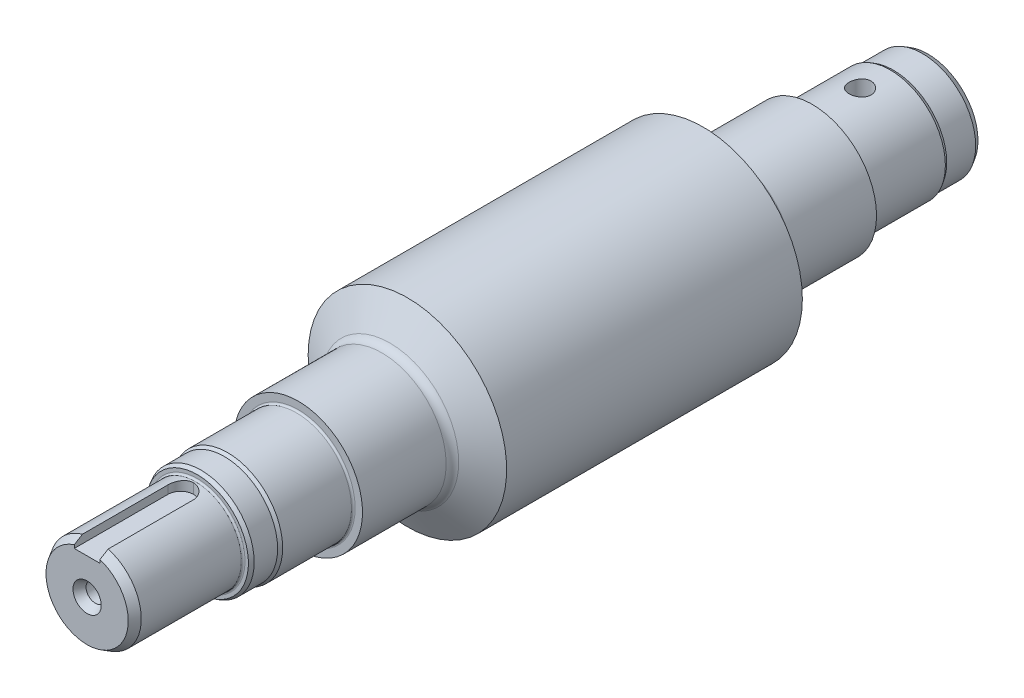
ISO-10303-21;
HEADER;
FILE_DESCRIPTION(('STEP AP214'),'2;1');
FILE_NAME('part.step','',(''),(''),'','','');
FILE_SCHEMA(('AUTOMOTIVE_DESIGN { 1 0 10303 214 1 1 1 1 }'));
ENDSEC;
DATA;
#1=APPLICATION_CONTEXT('core data for automotive mechanical design processes');
#2=APPLICATION_PROTOCOL_DEFINITION('international standard','automotive_design',2000,#1);
#3=PRODUCT_CONTEXT('',#1,'mechanical');
#4=PRODUCT('Part','Part','',(#3));
#5=PRODUCT_RELATED_PRODUCT_CATEGORY('part','',(#4));
#6=PRODUCT_DEFINITION_FORMATION('','',#4);
#7=PRODUCT_DEFINITION_CONTEXT('part definition',#1,'design');
#8=PRODUCT_DEFINITION('design','',#6,#7);
#9=PRODUCT_DEFINITION_SHAPE('','',#8);
#10=(LENGTH_UNIT() NAMED_UNIT(*) SI_UNIT(.MILLI.,.METRE.));
#11=(NAMED_UNIT(*) PLANE_ANGLE_UNIT() SI_UNIT($,.RADIAN.));
#12=(NAMED_UNIT(*) SI_UNIT($,.STERADIAN.) SOLID_ANGLE_UNIT());
#13=UNCERTAINTY_MEASURE_WITH_UNIT(LENGTH_MEASURE(1.E-05),#10,'distance_accuracy_value','');
#14=(GEOMETRIC_REPRESENTATION_CONTEXT(3) GLOBAL_UNCERTAINTY_ASSIGNED_CONTEXT((#13)) GLOBAL_UNIT_ASSIGNED_CONTEXT((#10,
#11,#12)) REPRESENTATION_CONTEXT('',''));
#15=CARTESIAN_POINT('',(0.,0.,0.));
#16=DIRECTION('',(0.,0.,1.));
#17=DIRECTION('',(1.,0.,0.));
#18=AXIS2_PLACEMENT_3D('',#15,#16,#17);
#19=CARTESIAN_POINT('',(0.,0.,145.52));
#20=DIRECTION('',(0.,0.,1.));
#21=DIRECTION('',(1.,0.,0.));
#22=AXIS2_PLACEMENT_3D('',#19,#20,#21);
#23=PLANE('',#22);
#24=CARTESIAN_POINT('',(0.,0.,145.52));
#25=DIRECTION('',(0.,0.,1.));
#26=DIRECTION('',(1.,0.,0.));
#27=AXIS2_PLACEMENT_3D('',#24,#25,#26);
#28=CIRCLE('',#27,31.);
#29=CARTESIAN_POINT('',(31.,0.,145.52));
#30=VERTEX_POINT('',#29);
#31=EDGE_CURVE('E225',#30,#30,#28,.F.);
#32=ORIENTED_EDGE('',*,*,#31,.T.);
#33=EDGE_LOOP('',(#32));
#34=FACE_BOUND('',#33,.T.);
#35=CARTESIAN_POINT('',(0.,0.,145.52));
#36=DIRECTION('',(0.,0.,1.));
#37=DIRECTION('',(1.,0.,0.));
#38=AXIS2_PLACEMENT_3D('',#35,#36,#37);
#39=CIRCLE('',#38,35.);
#40=CARTESIAN_POINT('',(-35.,0.,145.52));
#41=VERTEX_POINT('',#40);
#42=EDGE_CURVE('E340',#41,#41,#39,.T.);
#43=ORIENTED_EDGE('',*,*,#42,.T.);
#44=EDGE_LOOP('',(#43));
#45=FACE_BOUND('',#44,.T.);
#46=ADVANCED_FACE('F34',(#34,#45),#23,.T.);
#47=CARTESIAN_POINT('',(0.,0.,-134.48));
#48=DIRECTION('',(0.,0.,1.));
#49=DIRECTION('',(1.,0.,0.));
#50=AXIS2_PLACEMENT_3D('',#47,#48,#49);
#51=PLANE('',#50);
#52=CARTESIAN_POINT('',(0.,0.,-134.48));
#53=DIRECTION('',(0.,0.,1.));
#54=DIRECTION('',(1.,0.,0.));
#55=AXIS2_PLACEMENT_3D('',#52,#53,#54);
#56=CIRCLE('',#55,31.);
#57=CARTESIAN_POINT('',(31.,0.,-134.48));
#58=VERTEX_POINT('',#57);
#59=EDGE_CURVE('E231',#58,#58,#56,.T.);
#60=ORIENTED_EDGE('',*,*,#59,.T.);
#61=EDGE_LOOP('',(#60));
#62=FACE_BOUND('',#61,.T.);
#63=CARTESIAN_POINT('',(0.,0.,-134.48));
#64=DIRECTION('',(0.,0.,1.));
#65=DIRECTION('',(1.,0.,0.));
#66=AXIS2_PLACEMENT_3D('',#63,#64,#65);
#67=CIRCLE('',#66,35.);
#68=CARTESIAN_POINT('',(35.,0.,-134.48));
#69=VERTEX_POINT('',#68);
#70=EDGE_CURVE('E338',#69,#69,#67,.T.);
#71=ORIENTED_EDGE('',*,*,#70,.F.);
#72=EDGE_LOOP('',(#71));
#73=FACE_BOUND('',#72,.T.);
#74=ADVANCED_FACE('F296',(#62,#73),#51,.F.);
#75=CARTESIAN_POINT('',(0.,0.,100.));
#76=DIRECTION('',(0.,0.,-1.));
#77=DIRECTION('',(-1.,0.,0.));
#78=AXIS2_PLACEMENT_3D('',#75,#76,#77);
#79=CYLINDRICAL_SURFACE('',#78,54.069);
#80=CARTESIAN_POINT('',(0.,0.,-75.0175131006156));
#81=DIRECTION('',(0.,0.,1.));
#82=DIRECTION('',(1.,0.,0.));
#83=AXIS2_PLACEMENT_3D('',#80,#81,#82);
#84=CIRCLE('',#83,54.069);
#85=CARTESIAN_POINT('',(54.069,0.,-75.0175131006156));
#86=VERTEX_POINT('',#85);
#87=EDGE_CURVE('E361',#86,#86,#84,.F.);
#88=ORIENTED_EDGE('',*,*,#87,.F.);
#89=EDGE_LOOP('',(#88));
#90=FACE_BOUND('',#89,.T.);
#91=CARTESIAN_POINT('',(0.,0.,86.0575131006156));
#92=DIRECTION('',(0.,0.,-1.));
#93=DIRECTION('',(-1.,0.,0.));
#94=AXIS2_PLACEMENT_3D('',#91,#92,#93);
#95=CIRCLE('',#94,54.069);
#96=CARTESIAN_POINT('',(-54.069,0.,86.0575131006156));
#97=VERTEX_POINT('',#96);
#98=EDGE_CURVE('E356',#97,#97,#95,.F.);
#99=ORIENTED_EDGE('',*,*,#98,.F.);
#100=EDGE_LOOP('',(#99));
#101=FACE_BOUND('',#100,.T.);
#102=ADVANCED_FACE('F36',(#90,#101),#79,.T.);
#103=CARTESIAN_POINT('',(0.,0.,-74.48));
#104=DIRECTION('',(0.,0.,1.));
#105=DIRECTION('',(1.,0.,0.));
#106=AXIS2_PLACEMENT_3D('',#103,#104,#105);
#107=CONICAL_SURFACE('',#106,55.0000000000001,1.0471975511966);
#108=CARTESIAN_POINT('',(0.,0.,-84.5836297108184));
#109=DIRECTION('',(0.,0.,1.));
#110=DIRECTION('',(1.,0.,0.));
#111=AXIS2_PLACEMENT_3D('',#108,#109,#110);
#112=CIRCLE('',#111,37.5000000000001);
#113=CARTESIAN_POINT('',(37.5000000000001,0.,-84.5836297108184));
#114=VERTEX_POINT('',#113);
#115=EDGE_CURVE('E357',#114,#114,#112,.T.);
#116=ORIENTED_EDGE('',*,*,#115,.T.);
#117=EDGE_LOOP('',(#116));
#118=FACE_BOUND('',#117,.T.);
#119=ORIENTED_EDGE('',*,*,#87,.T.);
#120=EDGE_LOOP('',(#119));
#121=FACE_BOUND('',#120,.T.);
#122=ADVANCED_FACE('F320',(#118,#121),#107,.T.);
#123=CARTESIAN_POINT('',(0.,0.,-88.9137567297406));
#124=DIRECTION('',(0.,0.,1.));
#125=DIRECTION('',(1.,0.,0.));
#126=AXIS2_PLACEMENT_3D('',#123,#124,#125);
#127=TOROIDAL_SURFACE('',#126,40.0000000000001,5.);
#128=CARTESIAN_POINT('',(0.,0.,-88.9137567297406));
#129=DIRECTION('',(0.,0.,1.));
#130=DIRECTION('',(1.,0.,0.));
#131=AXIS2_PLACEMENT_3D('',#128,#129,#130);
#132=CIRCLE('',#131,35.0000000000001);
#133=CARTESIAN_POINT('',(35.,0.,-88.9137567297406));
#134=VERTEX_POINT('',#133);
#135=EDGE_CURVE('E335',#134,#134,#132,.T.);
#136=ORIENTED_EDGE('',*,*,#135,.T.);
#137=EDGE_LOOP('',(#136));
#138=FACE_BOUND('',#137,.T.);
#139=ORIENTED_EDGE('',*,*,#115,.F.);
#140=EDGE_LOOP('',(#139));
#141=FACE_BOUND('',#140,.T.);
#142=ADVANCED_FACE('F317',(#138,#141),#127,.F.);
#143=CARTESIAN_POINT('',(0.,0.,-125.52));
#144=DIRECTION('',(0.,0.,1.));
#145=DIRECTION('',(1.,0.,0.));
#146=AXIS2_PLACEMENT_3D('',#143,#144,#145);
#147=CYLINDRICAL_SURFACE('',#146,35.);
#148=CARTESIAN_POINT('',(35.,0.,-88.9137567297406));
#149=CARTESIAN_POINT('',(35.,0.,-89.3884050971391));
#150=CARTESIAN_POINT('',(35.,0.,-89.8630534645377));
#151=CARTESIAN_POINT('',(35.,0.,-90.8123501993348));
#152=CARTESIAN_POINT('',(35.,0.,-91.2869985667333));
#153=CARTESIAN_POINT('',(35.,0.,-92.2362953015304));
#154=CARTESIAN_POINT('',(35.,0.,-92.7109436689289));
#155=CARTESIAN_POINT('',(35.,0.,-93.660240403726));
#156=CARTESIAN_POINT('',(35.,0.,-94.1348887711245));
#157=CARTESIAN_POINT('',(35.,0.,-95.0841855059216));
#158=CARTESIAN_POINT('',(35.,0.,-95.5588338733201));
#159=CARTESIAN_POINT('',(35.,0.,-96.5081306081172));
#160=CARTESIAN_POINT('',(35.,0.,-96.9827789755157));
#161=CARTESIAN_POINT('',(35.,0.,-97.9320757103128));
#162=CARTESIAN_POINT('',(35.,0.,-98.4067240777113));
#163=CARTESIAN_POINT('',(35.,0.,-99.3560208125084));
#164=CARTESIAN_POINT('',(35.,0.,-99.8306691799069));
#165=CARTESIAN_POINT('',(35.,0.,-100.779965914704));
#166=CARTESIAN_POINT('',(35.,0.,-101.254614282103));
#167=CARTESIAN_POINT('',(35.,0.,-102.2039110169));
#168=CARTESIAN_POINT('',(35.,0.,-102.678559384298));
#169=CARTESIAN_POINT('',(35.,0.,-103.627856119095));
#170=CARTESIAN_POINT('',(35.,0.,-104.102504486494));
#171=CARTESIAN_POINT('',(35.,0.,-105.051801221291));
#172=CARTESIAN_POINT('',(35.,0.,-105.526449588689));
#173=CARTESIAN_POINT('',(35.,0.,-106.475746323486));
#174=CARTESIAN_POINT('',(35.,0.,-106.950394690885));
#175=CARTESIAN_POINT('',(35.,0.,-107.899691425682));
#176=CARTESIAN_POINT('',(35.,0.,-108.374339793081));
#177=CARTESIAN_POINT('',(35.,0.,-109.323636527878));
#178=CARTESIAN_POINT('',(35.,0.,-109.798284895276));
#179=CARTESIAN_POINT('',(35.,0.,-110.747581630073));
#180=CARTESIAN_POINT('',(35.,0.,-111.222229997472));
#181=CARTESIAN_POINT('',(35.,0.,-112.171526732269));
#182=CARTESIAN_POINT('',(35.,0.,-112.646175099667));
#183=CARTESIAN_POINT('',(35.,0.,-113.595471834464));
#184=CARTESIAN_POINT('',(35.,0.,-114.070120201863));
#185=CARTESIAN_POINT('',(35.,0.,-115.01941693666));
#186=CARTESIAN_POINT('',(35.,0.,-115.494065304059));
#187=CARTESIAN_POINT('',(35.,0.,-116.443362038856));
#188=CARTESIAN_POINT('',(35.,0.,-116.918010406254));
#189=CARTESIAN_POINT('',(35.,0.,-117.867307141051));
#190=CARTESIAN_POINT('',(35.,0.,-118.34195550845));
#191=CARTESIAN_POINT('',(35.,0.,-119.291252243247));
#192=CARTESIAN_POINT('',(35.,0.,-119.765900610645));
#193=CARTESIAN_POINT('',(35.,0.,-120.715197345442));
#194=CARTESIAN_POINT('',(35.,0.,-121.189845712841));
#195=CARTESIAN_POINT('',(35.,0.,-122.139142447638));
#196=CARTESIAN_POINT('',(35.,0.,-122.613790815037));
#197=CARTESIAN_POINT('',(35.,0.,-123.563087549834));
#198=CARTESIAN_POINT('',(35.,0.,-124.037735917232));
#199=CARTESIAN_POINT('',(35.,0.,-124.987032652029));
#200=CARTESIAN_POINT('',(35.,0.,-125.461681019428));
#201=CARTESIAN_POINT('',(35.,0.,-126.410977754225));
#202=CARTESIAN_POINT('',(35.,0.,-126.885626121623));
#203=CARTESIAN_POINT('',(35.,0.,-127.834922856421));
#204=CARTESIAN_POINT('',(35.,0.,-128.309571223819));
#205=CARTESIAN_POINT('',(35.,0.,-129.258867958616));
#206=CARTESIAN_POINT('',(35.,0.,-129.733516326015));
#207=CARTESIAN_POINT('',(35.,0.,-130.682813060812));
#208=CARTESIAN_POINT('',(35.,0.,-131.15746142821));
#209=CARTESIAN_POINT('',(35.,0.,-132.106758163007));
#210=CARTESIAN_POINT('',(35.,0.,-132.581406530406));
#211=CARTESIAN_POINT('',(35.,0.,-133.530703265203));
#212=CARTESIAN_POINT('',(35.,0.,-134.005351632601));
#213=CARTESIAN_POINT('',(35.,0.,-134.48));
#214=B_SPLINE_CURVE_WITH_KNOTS('',3,(#148,#149,#150,#151,#152,#153,#154,#155,#156,#157,#158,
#159,#160,#161,#162,#163,#164,#165,#166,#167,#168,#169,#170,#171,#172,#173,#174,#175,#176,#177,
#178,#179,#180,#181,#182,#183,#184,#185,#186,#187,#188,#189,#190,#191,#192,#193,#194,#195,#196,
#197,#198,#199,#200,#201,#202,#203,#204,#205,#206,#207,#208,#209,#210,#211,#212,#213),
.UNSPECIFIED.,.F.,.F.,(4,2,2,2,2,2,2,2,2,2,2,2,2,2,2,2,2,2,2,2,2,2,2,2,2,2,2,2,2,2,2,2,4),(0.,
1.42394510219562,2.84789020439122,4.27183530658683,5.69578040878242,7.11972551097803,
8.54367061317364,9.96761571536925,11.3915608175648,12.8155059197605,14.2394510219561,
15.6633961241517,17.0873412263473,18.5112863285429,19.9352314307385,21.3591765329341,
22.7831216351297,24.2070667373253,25.6310118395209,27.0549569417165,28.4789020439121,
29.9028471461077,31.3267922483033,32.7507373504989,34.1746824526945,35.5986275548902,
37.0225726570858,38.4465177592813,39.870462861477,41.2944079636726,42.7183530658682,
44.1422981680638,45.5662432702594),.UNSPECIFIED.);
#215=EDGE_CURVE('BSEAM315',#134,#69,#214,.T.);
#216=ORIENTED_EDGE('',*,*,#135,.F.);
#217=ORIENTED_EDGE('',*,*,#70,.T.);
#218=ORIENTED_EDGE('',*,*,#215,.T.);
#219=ORIENTED_EDGE('',*,*,#215,.F.);
#220=EDGE_LOOP('',(#216,#218,#217,#219));
#221=FACE_BOUND('',#220,.T.);
#222=ADVANCED_FACE('F315',(#221),#147,.T.);
#223=CARTESIAN_POINT('',(0.,0.,95.6236297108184));
#224=DIRECTION('',(0.,0.,-1.));
#225=DIRECTION('',(-1.,0.,0.));
#226=AXIS2_PLACEMENT_3D('',#223,#224,#225);
#227=CONICAL_SURFACE('',#226,37.5,1.0471975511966);
#228=CARTESIAN_POINT('',(0.,0.,95.6236297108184));
#229=DIRECTION('',(0.,0.,1.));
#230=DIRECTION('',(1.,0.,0.));
#231=AXIS2_PLACEMENT_3D('',#228,#229,#230);
#232=CIRCLE('',#231,37.5);
#233=CARTESIAN_POINT('',(37.5,0.,95.6236297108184));
#234=VERTEX_POINT('',#233);
#235=EDGE_CURVE('E353',#234,#234,#232,.T.);
#236=ORIENTED_EDGE('',*,*,#235,.F.);
#237=EDGE_LOOP('',(#236));
#238=FACE_BOUND('',#237,.T.);
#239=ORIENTED_EDGE('',*,*,#98,.T.);
#240=EDGE_LOOP('',(#239));
#241=FACE_BOUND('',#240,.T.);
#242=ADVANCED_FACE('F311',(#238,#241),#227,.T.);
#243=CARTESIAN_POINT('',(0.,0.,99.9537567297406));
#244=DIRECTION('',(0.,0.,1.));
#245=DIRECTION('',(1.,0.,0.));
#246=AXIS2_PLACEMENT_3D('',#243,#244,#245);
#247=TOROIDAL_SURFACE('',#246,40.,5.);
#248=ORIENTED_EDGE('',*,*,#235,.T.);
#249=EDGE_LOOP('',(#248));
#250=FACE_BOUND('',#249,.T.);
#251=CARTESIAN_POINT('',(0.,0.,99.9537567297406));
#252=DIRECTION('',(0.,0.,1.));
#253=DIRECTION('',(1.,0.,0.));
#254=AXIS2_PLACEMENT_3D('',#251,#252,#253);
#255=CIRCLE('',#254,35.);
#256=CARTESIAN_POINT('',(-35.,0.,99.9537567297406));
#257=VERTEX_POINT('',#256);
#258=EDGE_CURVE('E344',#257,#257,#255,.T.);
#259=ORIENTED_EDGE('',*,*,#258,.F.);
#260=EDGE_LOOP('',(#259));
#261=FACE_BOUND('',#260,.T.);
#262=ADVANCED_FACE('F307',(#250,#261),#247,.F.);
#263=CARTESIAN_POINT('',(0.,0.,125.52));
#264=DIRECTION('',(0.,0.,-1.));
#265=DIRECTION('',(-1.,0.,0.));
#266=AXIS2_PLACEMENT_3D('',#263,#264,#265);
#267=CYLINDRICAL_SURFACE('',#266,35.);
#268=CARTESIAN_POINT('',(-35.,0.,99.9537567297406));
#269=CARTESIAN_POINT('',(-35.,0.,100.428405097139));
#270=CARTESIAN_POINT('',(-35.,0.,100.903053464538));
#271=CARTESIAN_POINT('',(-35.,0.,101.852350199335));
#272=CARTESIAN_POINT('',(-35.,0.,102.326998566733));
#273=CARTESIAN_POINT('',(-35.,0.,103.27629530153));
#274=CARTESIAN_POINT('',(-35.,0.,103.750943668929));
#275=CARTESIAN_POINT('',(-35.,0.,104.700240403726));
#276=CARTESIAN_POINT('',(-35.,0.,105.174888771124));
#277=CARTESIAN_POINT('',(-35.,0.,106.124185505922));
#278=CARTESIAN_POINT('',(-35.,0.,106.59883387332));
#279=CARTESIAN_POINT('',(-35.,0.,107.548130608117));
#280=CARTESIAN_POINT('',(-35.,0.,108.022778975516));
#281=CARTESIAN_POINT('',(-35.,0.,108.972075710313));
#282=CARTESIAN_POINT('',(-35.,0.,109.446724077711));
#283=CARTESIAN_POINT('',(-35.,0.,110.396020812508));
#284=CARTESIAN_POINT('',(-35.,0.,110.870669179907));
#285=CARTESIAN_POINT('',(-35.,0.,111.819965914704));
#286=CARTESIAN_POINT('',(-35.,0.,112.294614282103));
#287=CARTESIAN_POINT('',(-35.,0.,113.2439110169));
#288=CARTESIAN_POINT('',(-35.,0.,113.718559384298));
#289=CARTESIAN_POINT('',(-35.,0.,114.667856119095));
#290=CARTESIAN_POINT('',(-35.,0.,115.142504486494));
#291=CARTESIAN_POINT('',(-35.,0.,116.091801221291));
#292=CARTESIAN_POINT('',(-35.,0.,116.566449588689));
#293=CARTESIAN_POINT('',(-35.,0.,117.515746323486));
#294=CARTESIAN_POINT('',(-35.,0.,117.990394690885));
#295=CARTESIAN_POINT('',(-35.,0.,118.939691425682));
#296=CARTESIAN_POINT('',(-35.,0.,119.414339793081));
#297=CARTESIAN_POINT('',(-35.,0.,120.363636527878));
#298=CARTESIAN_POINT('',(-35.,0.,120.838284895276));
#299=CARTESIAN_POINT('',(-35.,0.,121.787581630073));
#300=CARTESIAN_POINT('',(-35.,0.,122.262229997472));
#301=CARTESIAN_POINT('',(-35.,0.,123.211526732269));
#302=CARTESIAN_POINT('',(-35.,0.,123.686175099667));
#303=CARTESIAN_POINT('',(-35.,0.,124.635471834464));
#304=CARTESIAN_POINT('',(-35.,0.,125.110120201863));
#305=CARTESIAN_POINT('',(-35.,0.,126.05941693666));
#306=CARTESIAN_POINT('',(-35.,0.,126.534065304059));
#307=CARTESIAN_POINT('',(-35.,0.,127.483362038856));
#308=CARTESIAN_POINT('',(-35.,0.,127.958010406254));
#309=CARTESIAN_POINT('',(-35.,0.,128.907307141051));
#310=CARTESIAN_POINT('',(-35.,0.,129.38195550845));
#311=CARTESIAN_POINT('',(-35.,0.,130.331252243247));
#312=CARTESIAN_POINT('',(-35.,0.,130.805900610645));
#313=CARTESIAN_POINT('',(-35.,0.,131.755197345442));
#314=CARTESIAN_POINT('',(-35.,0.,132.229845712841));
#315=CARTESIAN_POINT('',(-35.,0.,133.179142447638));
#316=CARTESIAN_POINT('',(-35.,0.,133.653790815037));
#317=CARTESIAN_POINT('',(-35.,0.,134.603087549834));
#318=CARTESIAN_POINT('',(-35.,0.,135.077735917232));
#319=CARTESIAN_POINT('',(-35.,0.,136.027032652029));
#320=CARTESIAN_POINT('',(-35.,0.,136.501681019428));
#321=CARTESIAN_POINT('',(-35.,0.,137.450977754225));
#322=CARTESIAN_POINT('',(-35.,0.,137.925626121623));
#323=CARTESIAN_POINT('',(-35.,0.,138.874922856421));
#324=CARTESIAN_POINT('',(-35.,0.,139.349571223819));
#325=CARTESIAN_POINT('',(-35.,0.,140.298867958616));
#326=CARTESIAN_POINT('',(-35.,0.,140.773516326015));
#327=CARTESIAN_POINT('',(-35.,0.,141.722813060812));
#328=CARTESIAN_POINT('',(-35.,0.,142.19746142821));
#329=CARTESIAN_POINT('',(-35.,0.,143.146758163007));
#330=CARTESIAN_POINT('',(-35.,0.,143.621406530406));
#331=CARTESIAN_POINT('',(-35.,0.,144.570703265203));
#332=CARTESIAN_POINT('',(-35.,0.,145.045351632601));
#333=CARTESIAN_POINT('',(-35.,0.,145.52));
#334=B_SPLINE_CURVE_WITH_KNOTS('',3,(#268,#269,#270,#271,#272,#273,#274,#275,#276,#277,#278,
#279,#280,#281,#282,#283,#284,#285,#286,#287,#288,#289,#290,#291,#292,#293,#294,#295,#296,#297,
#298,#299,#300,#301,#302,#303,#304,#305,#306,#307,#308,#309,#310,#311,#312,#313,#314,#315,#316,
#317,#318,#319,#320,#321,#322,#323,#324,#325,#326,#327,#328,#329,#330,#331,#332,#333),
.UNSPECIFIED.,.F.,.F.,(4,2,2,2,2,2,2,2,2,2,2,2,2,2,2,2,2,2,2,2,2,2,2,2,2,2,2,2,2,2,2,2,4),(0.,
1.42394510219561,2.8478902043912,4.27183530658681,5.69578040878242,7.11972551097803,
8.54367061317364,9.96761571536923,11.3915608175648,12.8155059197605,14.2394510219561,
15.6633961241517,17.0873412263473,18.5112863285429,19.9352314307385,21.3591765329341,
22.7831216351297,24.2070667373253,25.6310118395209,27.0549569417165,28.4789020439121,
29.9028471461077,31.3267922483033,32.750737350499,34.1746824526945,35.5986275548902,
37.0225726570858,38.4465177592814,39.870462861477,41.2944079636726,42.7183530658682,
44.1422981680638,45.5662432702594),.UNSPECIFIED.);
#335=EDGE_CURVE('BSEAM310',#257,#41,#334,.T.);
#336=ORIENTED_EDGE('',*,*,#258,.T.);
#337=ORIENTED_EDGE('',*,*,#42,.F.);
#338=ORIENTED_EDGE('',*,*,#335,.T.);
#339=ORIENTED_EDGE('',*,*,#335,.F.);
#340=EDGE_LOOP('',(#336,#338,#337,#339));
#341=FACE_BOUND('',#340,.T.);
#342=ADVANCED_FACE('F310',(#341),#267,.T.);
#343=CARTESIAN_POINT('',(-29.,0.,-197.48));
#344=DIRECTION('',(0.,0.,1.));
#345=DIRECTION('',(1.,0.,0.));
#346=AXIS2_PLACEMENT_3D('',#343,#344,#345);
#347=PLANE('',#346);
#348=CARTESIAN_POINT('',(0.,0.,-197.48));
#349=DIRECTION('',(0.,0.,1.));
#350=DIRECTION('',(1.,0.,0.));
#351=AXIS2_PLACEMENT_3D('',#348,#349,#350);
#352=CIRCLE('',#351,27.2679491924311);
#353=CARTESIAN_POINT('',(27.2679491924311,0.,-197.48));
#354=VERTEX_POINT('',#353);
#355=EDGE_CURVE('E249',#354,#354,#352,.F.);
#356=ORIENTED_EDGE('',*,*,#355,.T.);
#357=EDGE_LOOP('',(#356));
#358=FACE_BOUND('',#357,.T.);
#359=DIRECTION('',(0.,1.,0.));
#360=VECTOR('',#359,1.);
#361=CARTESIAN_POINT('',(-4.00000000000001,18.3,-197.48));
#362=LINE('',#361,#360);
#363=CARTESIAN_POINT('',(-4.00000000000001,16.5227116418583,-197.48));
#364=VERTEX_POINT('',#363);
#365=CARTESIAN_POINT('',(-4.00000000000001,18.3,-197.48));
#366=VERTEX_POINT('',#365);
#367=EDGE_CURVE('E795',#364,#366,#362,.T.);
#368=ORIENTED_EDGE('',*,*,#367,.F.);
#369=CARTESIAN_POINT('',(0.,0.,-197.48));
#370=DIRECTION('',(0.,0.,1.));
#371=DIRECTION('',(1.,0.,0.));
#372=AXIS2_PLACEMENT_3D('',#369,#370,#371);
#373=CIRCLE('',#372,17.);
#374=CARTESIAN_POINT('',(3.99999999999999,16.5227116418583,-197.48));
#375=VERTEX_POINT('',#374);
#376=EDGE_CURVE('E207',#364,#375,#373,.T.);
#377=ORIENTED_EDGE('',*,*,#376,.T.);
#378=DIRECTION('',(0.,-1.,0.));
#379=VECTOR('',#378,1.);
#380=CARTESIAN_POINT('',(3.99999999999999,18.3,-197.48));
#381=LINE('',#380,#379);
#382=CARTESIAN_POINT('',(3.99999999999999,18.3,-197.48));
#383=VERTEX_POINT('',#382);
#384=EDGE_CURVE('E791',#383,#375,#381,.T.);
#385=ORIENTED_EDGE('',*,*,#384,.F.);
#386=DIRECTION('',(1.,0.,0.));
#387=VECTOR('',#386,1.);
#388=CARTESIAN_POINT('',(3.99999999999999,18.3,-197.48));
#389=LINE('',#388,#387);
#390=EDGE_CURVE('E797',#366,#383,#389,.T.);
#391=ORIENTED_EDGE('',*,*,#390,.F.);
#392=EDGE_LOOP('',(#368,#377,#385,#391));
#393=FACE_BOUND('',#392,.T.);
#394=ADVANCED_FACE('F326',(#358,#393),#347,.F.);
#395=CARTESIAN_POINT('',(0.,0.,0.));
#396=DIRECTION('',(0.,0.,1.));
#397=DIRECTION('',(1.,0.,0.));
#398=AXIS2_PLACEMENT_3D('',#395,#396,#397);
#399=CYLINDRICAL_SURFACE('',#398,29.);
#400=CARTESIAN_POINT('',(0.,0.,-194.48));
#401=DIRECTION('',(0.,0.,1.));
#402=DIRECTION('',(1.,0.,0.));
#403=AXIS2_PLACEMENT_3D('',#400,#401,#402);
#404=CIRCLE('',#403,29.);
#405=CARTESIAN_POINT('',(29.,0.,-194.48));
#406=VERTEX_POINT('',#405);
#407=EDGE_CURVE('E246',#406,#406,#404,.T.);
#408=ORIENTED_EDGE('',*,*,#407,.T.);
#409=EDGE_LOOP('',(#408));
#410=FACE_BOUND('',#409,.T.);
#411=CARTESIAN_POINT('',(0.,0.,-178.712050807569));
#412=DIRECTION('',(0.,0.,1.));
#413=DIRECTION('',(1.,0.,0.));
#414=AXIS2_PLACEMENT_3D('',#411,#412,#413);
#415=CIRCLE('',#414,29.);
#416=CARTESIAN_POINT('',(29.,0.,-178.712050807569));
#417=VERTEX_POINT('',#416);
#418=EDGE_CURVE('E341',#417,#417,#415,.T.);
#419=ORIENTED_EDGE('',*,*,#418,.F.);
#420=EDGE_LOOP('',(#419));
#421=FACE_BOUND('',#420,.T.);
#422=ADVANCED_FACE('F413',(#410,#421),#399,.T.);
#423=CARTESIAN_POINT('',(0.,0.,-178.712050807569));
#424=DIRECTION('',(0.,0.,1.));
#425=DIRECTION('',(1.,0.,0.));
#426=AXIS2_PLACEMENT_3D('',#423,#424,#425);
#427=CONICAL_SURFACE('',#426,29.,0.523598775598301);
#428=CARTESIAN_POINT('',(0.,0.,-176.98));
#429=DIRECTION('',(0.,0.,1.));
#430=DIRECTION('',(1.,0.,0.));
#431=AXIS2_PLACEMENT_3D('',#428,#429,#430);
#432=CIRCLE('',#431,30.);
#433=CARTESIAN_POINT('',(30.,0.,-176.98));
#434=VERTEX_POINT('',#433);
#435=EDGE_CURVE('E347',#434,#434,#432,.T.);
#436=ORIENTED_EDGE('',*,*,#435,.F.);
#437=EDGE_LOOP('',(#436));
#438=FACE_BOUND('',#437,.T.);
#439=ORIENTED_EDGE('',*,*,#418,.T.);
#440=EDGE_LOOP('',(#439));
#441=FACE_BOUND('',#440,.T.);
#442=ADVANCED_FACE('F410',(#438,#441),#427,.T.);
#443=CARTESIAN_POINT('',(0.,0.,0.));
#444=DIRECTION('',(0.,0.,1.));
#445=DIRECTION('',(1.,0.,0.));
#446=AXIS2_PLACEMENT_3D('',#443,#444,#445);
#447=CYLINDRICAL_SURFACE('',#446,30.);
#448=CARTESIAN_POINT('',(0.,0.,-135.48));
#449=DIRECTION('',(0.,0.,1.));
#450=DIRECTION('',(1.,0.,0.));
#451=AXIS2_PLACEMENT_3D('',#448,#449,#450);
#452=CIRCLE('',#451,30.);
#453=CARTESIAN_POINT('',(30.,0.,-135.48));
#454=VERTEX_POINT('',#453);
#455=EDGE_CURVE('E228',#454,#454,#452,.F.);
#456=ORIENTED_EDGE('',*,*,#455,.T.);
#457=EDGE_LOOP('',(#456));
#458=FACE_BOUND('',#457,.T.);
#459=CARTESIAN_POINT('',(0.,30.,-166.48));
#460=CARTESIAN_POINT('',(0.16678665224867,30.0000016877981,-166.480003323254));
#461=CARTESIAN_POINT('',(0.333531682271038,29.9986067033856,-166.473043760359));
#462=CARTESIAN_POINT('',(0.665867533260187,29.9930693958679,-166.44526720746));
#463=CARTESIAN_POINT('',(0.831458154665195,29.9889266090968,-166.424447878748));
#464=CARTESIAN_POINT('',(1.16032458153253,29.9780042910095,-166.36909772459));
#465=CARTESIAN_POINT('',(1.32359914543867,29.9712233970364,-166.334559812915));
#466=CARTESIAN_POINT('',(1.64665330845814,29.9552115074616,-166.252030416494));
#467=CARTESIAN_POINT('',(1.80643159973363,29.9459796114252,-166.204033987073));
#468=CARTESIAN_POINT('',(2.12109983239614,29.9253365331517,-166.095035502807));
#469=CARTESIAN_POINT('',(2.27599604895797,29.9139282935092,-166.034050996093));
#470=CARTESIAN_POINT('',(2.58011997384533,29.8892333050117,-165.89946882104));
#471=CARTESIAN_POINT('',(2.72934556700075,29.8759458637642,-165.825866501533));
#472=CARTESIAN_POINT('',(3.02099738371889,29.847864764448,-165.666633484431));
#473=CARTESIAN_POINT('',(3.16342661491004,29.8330717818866,-165.581008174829));
#474=CARTESIAN_POINT('',(3.44066424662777,29.8023705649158,-165.398272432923));
#475=CARTESIAN_POINT('',(3.57546977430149,29.7864619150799,-165.301157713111));
#476=CARTESIAN_POINT('',(3.83805424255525,29.7537737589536,-165.094925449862));
#477=CARTESIAN_POINT('',(3.96573181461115,29.736986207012,-164.985680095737));
#478=CARTESIAN_POINT('',(4.21150797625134,29.7031748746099,-164.75684513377));
#479=CARTESIAN_POINT('',(4.32960299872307,29.6861510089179,-164.63725170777));
#480=CARTESIAN_POINT('',(4.55533107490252,29.6523520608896,-164.388598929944));
#481=CARTESIAN_POINT('',(4.66296713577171,29.6355769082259,-164.25954231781));
#482=CARTESIAN_POINT('',(4.86711503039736,29.6027344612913,-163.992750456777));
#483=CARTESIAN_POINT('',(4.96362274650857,29.5866674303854,-163.855012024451));
#484=CARTESIAN_POINT('',(5.14558410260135,29.555567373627,-163.570584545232));
#485=CARTESIAN_POINT('',(5.23093360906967,29.5405446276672,-163.423827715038));
#486=CARTESIAN_POINT('',(5.38897820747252,29.5121223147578,-163.12343216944));
#487=CARTESIAN_POINT('',(5.46166855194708,29.4987233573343,-162.969790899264));
#488=CARTESIAN_POINT('',(5.5937745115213,29.4739582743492,-162.656811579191));
#489=CARTESIAN_POINT('',(5.65319606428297,29.4625912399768,-162.497476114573));
#490=CARTESIAN_POINT('',(5.75835702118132,29.4422171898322,-162.174188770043));
#491=CARTESIAN_POINT('',(5.80409146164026,29.4332110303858,-162.010235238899));
#492=CARTESIAN_POINT('',(5.91908595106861,29.4103859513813,-161.517685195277));
#493=CARTESIAN_POINT('',(5.96802935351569,29.4003929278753,-161.183895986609));
#494=CARTESIAN_POINT('',(6.00933039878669,29.391977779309,-160.512889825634));
#495=CARTESIAN_POINT('',(6.00169382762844,29.3935544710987,-160.175673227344));
#496=CARTESIAN_POINT('',(5.93072281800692,29.4079543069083,-159.512532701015));
#497=CARTESIAN_POINT('',(5.86823000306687,29.4206075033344,-159.186515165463));
#498=CARTESIAN_POINT('',(5.69062854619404,29.4554724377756,-158.549699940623));
#499=CARTESIAN_POINT('',(5.57551739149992,29.4776846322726,-158.238902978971));
#500=CARTESIAN_POINT('',(5.29514836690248,29.5293371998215,-157.638909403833));
#501=CARTESIAN_POINT('',(5.12955681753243,29.5588254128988,-157.349872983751));
#502=CARTESIAN_POINT('',(4.75316153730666,29.6216771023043,-156.803374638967));
#503=CARTESIAN_POINT('',(4.54235261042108,29.6550410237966,-156.545916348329));
#504=CARTESIAN_POINT('',(4.07699958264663,29.7226212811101,-156.065023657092));
#505=CARTESIAN_POINT('',(3.82173696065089,29.7568421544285,-155.842284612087));
#506=CARTESIAN_POINT('',(3.27711015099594,29.8217309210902,-155.442676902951));
#507=CARTESIAN_POINT('',(2.98774552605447,29.8523987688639,-155.265808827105));
#508=CARTESIAN_POINT('',(2.38235631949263,29.9068014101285,-154.962834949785));
#509=CARTESIAN_POINT('',(2.06629091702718,29.9305253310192,-154.836808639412));
#510=CARTESIAN_POINT('',(1.41689385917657,29.9682845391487,-154.63983715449));
#511=CARTESIAN_POINT('',(1.0835643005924,29.9823210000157,-154.568885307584));
#512=CARTESIAN_POINT('',(0.415076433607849,29.9989603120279,-154.485061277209));
#513=CARTESIAN_POINT('',(0.0800419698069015,30.0017504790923,-154.471237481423));
#514=CARTESIAN_POINT('',(-0.58754960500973,29.996103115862,-154.499499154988));
#515=CARTESIAN_POINT('',(-0.920106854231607,29.987666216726,-154.541581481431));
#516=CARTESIAN_POINT('',(-1.57023396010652,29.960629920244,-154.679670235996));
#517=CARTESIAN_POINT('',(-1.8879116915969,29.9421225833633,-154.775188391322));
#518=CARTESIAN_POINT('',(-2.5027417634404,29.8970131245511,-155.016903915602));
#519=CARTESIAN_POINT('',(-2.79989256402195,29.8704103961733,-155.163105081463));
#520=CARTESIAN_POINT('',(-3.36924704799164,29.8115946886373,-155.504094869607));
#521=CARTESIAN_POINT('',(-3.64110078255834,29.7793170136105,-155.699456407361));
#522=CARTESIAN_POINT('',(-4.14850809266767,29.7128841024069,-156.132455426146));
#523=CARTESIAN_POINT('',(-4.38405777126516,29.6787286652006,-156.370097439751));
#524=CARTESIAN_POINT('',(-4.81584362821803,29.6117581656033,-156.885239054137));
#525=CARTESIAN_POINT('',(-5.0114265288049,29.5789714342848,-157.163290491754));
#526=CARTESIAN_POINT('',(-5.35311220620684,29.5190516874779,-157.748872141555));
#527=CARTESIAN_POINT('',(-5.49921696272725,29.4919184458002,-158.056401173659));
#528=CARTESIAN_POINT('',(-5.73691221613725,29.4466037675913,-158.690594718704));
#529=CARTESIAN_POINT('',(-5.82878534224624,29.4283760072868,-159.017150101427));
#530=CARTESIAN_POINT('',(-5.95624756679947,29.4028486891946,-159.681655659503));
#531=CARTESIAN_POINT('',(-5.99184400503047,29.3955477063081,-160.019604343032));
#532=CARTESIAN_POINT('',(-6.00215206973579,29.3934346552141,-160.524004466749));
#533=CARTESIAN_POINT('',(-5.99862026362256,29.3941596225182,-160.690271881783));
#534=CARTESIAN_POINT('',(-5.9777838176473,29.398405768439,-161.02188855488));
#535=CARTESIAN_POINT('',(-5.96048440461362,29.4019258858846,-161.18723813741));
#536=CARTESIAN_POINT('',(-5.91223531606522,29.4116654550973,-161.515898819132));
#537=CARTESIAN_POINT('',(-5.8812808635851,29.4178858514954,-161.679209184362));
#538=CARTESIAN_POINT('',(-5.80598159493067,29.4328396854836,-162.002535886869));
#539=CARTESIAN_POINT('',(-5.76164155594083,29.4415722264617,-162.162553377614));
#540=CARTESIAN_POINT('',(-5.66001374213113,29.4612782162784,-162.477907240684));
#541=CARTESIAN_POINT('',(-5.60275321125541,29.4722469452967,-162.633252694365));
#542=CARTESIAN_POINT('',(-5.47568162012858,29.4961198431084,-162.938502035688));
#543=CARTESIAN_POINT('',(-5.40587500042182,29.5090233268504,-163.088407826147));
#544=CARTESIAN_POINT('',(-5.25416908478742,29.5364122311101,-163.381897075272));
#545=CARTESIAN_POINT('',(-5.1722647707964,29.550898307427,-163.525477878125));
#546=CARTESIAN_POINT('',(-4.99698841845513,29.5810413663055,-163.805259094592));
#547=CARTESIAN_POINT('',(-4.90362031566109,29.5966979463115,-163.941462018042));
#548=CARTESIAN_POINT('',(-4.70431042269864,29.6290369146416,-164.207952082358));
#549=CARTESIAN_POINT('',(-4.59817846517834,29.6457323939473,-164.338095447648));
#550=CARTESIAN_POINT('',(-4.37544580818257,29.6794230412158,-164.588965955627));
#551=CARTESIAN_POINT('',(-4.25884879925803,29.696418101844,-164.709696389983));
#552=CARTESIAN_POINT('',(-4.01586865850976,29.7302514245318,-164.941048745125));
#553=CARTESIAN_POINT('',(-3.88947977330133,29.7470895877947,-165.051664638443));
#554=CARTESIAN_POINT('',(-3.62787334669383,29.7801260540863,-165.261912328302));
#555=CARTESIAN_POINT('',(-3.49265907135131,29.7963245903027,-165.361548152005));
#556=CARTESIAN_POINT('',(-3.21275204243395,29.8278103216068,-165.55020873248));
#557=CARTESIAN_POINT('',(-3.06797223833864,29.8430856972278,-165.639106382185));
#558=CARTESIAN_POINT('',(-2.77133359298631,29.8720925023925,-165.804333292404));
#559=CARTESIAN_POINT('',(-2.61947738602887,29.8858245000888,-165.880667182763));
#560=CARTESIAN_POINT('',(-2.30978799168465,29.9113522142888,-166.020189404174));
#561=CARTESIAN_POINT('',(-2.15195848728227,29.923149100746,-166.083385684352));
#562=CARTESIAN_POINT('',(-1.83142130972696,29.9444772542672,-166.196185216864));
#563=CARTESIAN_POINT('',(-1.66871458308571,29.9540089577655,-166.245791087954));
#564=CARTESIAN_POINT('',(-1.25904258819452,29.974570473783,-166.351867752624));
#565=CARTESIAN_POINT('',(-1.00974899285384,29.9840570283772,-166.399851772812));
#566=CARTESIAN_POINT('',(-0.506938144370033,29.9967704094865,-166.463914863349));
#567=CARTESIAN_POINT('',(-0.253421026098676,29.9999974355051,-166.47999495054));
#568=CARTESIAN_POINT('',(0.,30.,-166.48));
#569=B_SPLINE_CURVE_WITH_KNOTS('',3,(#459,#460,#461,#462,#463,#464,#465,#466,#467,#468,#469,
#470,#471,#472,#473,#474,#475,#476,#477,#478,#479,#480,#481,#482,#483,#484,#485,#486,#487,#488,
#489,#490,#491,#492,#493,#494,#495,#496,#497,#498,#499,#500,#501,#502,#503,#504,#505,#506,#507,
#508,#509,#510,#511,#512,#513,#514,#515,#516,#517,#518,#519,#520,#521,#522,#523,#524,#525,#526,
#527,#528,#529,#530,#531,#532,#533,#534,#535,#536,#537,#538,#539,#540,#541,#542,#543,#544,#545,
#546,#547,#548,#549,#550,#551,#552,#553,#554,#555,#556,#557,#558,#559,#560,#561,#562,#563,#564,
#565,#566,#567,#568),.UNSPECIFIED.,.T.,.F.,(4,2,2,2,2,2,2,2,2,2,2,2,2,2,2,2,2,2,2,2,2,2,2,2,2,2,
2,2,2,2,2,2,2,2,2,2,2,2,2,2,2,2,2,2,2,2,2,2,2,2,2,2,2,2,4),(0.,0.50013743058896,
1.00035927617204,1.50083984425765,2.0015045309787,2.50149701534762,3.00167420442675,
3.50162795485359,4.00176886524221,4.50779597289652,5.01401059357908,5.52007923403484,
6.02633453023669,6.53702041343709,7.04789740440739,7.55854532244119,8.06937820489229,
9.07654034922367,10.0835994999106,11.0754728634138,12.0673935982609,13.0660186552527,
14.0647585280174,15.0814643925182,16.0981832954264,17.1164857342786,18.1346647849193,
19.1358133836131,20.1369057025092,21.1289964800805,22.1211615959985,23.1254732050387,
24.129892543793,25.1496069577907,26.1692805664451,27.1835921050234,28.1977713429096,
28.6962037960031,29.1944471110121,29.6928648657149,30.1911049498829,30.6883041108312,
31.1853276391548,31.6825579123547,32.1796179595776,32.6853083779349,33.1908211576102,
33.6966332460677,34.2022591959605,34.7133809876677,35.2243140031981,35.7349369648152,
36.2454614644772,37.0054106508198,37.7653356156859),.UNSPECIFIED.);
#570=CARTESIAN_POINT('',(0.,30.,-166.48));
#571=VERTEX_POINT('',#570);
#572=EDGE_CURVE('E170',#571,#571,#569,.T.);
#573=ORIENTED_EDGE('',*,*,#572,.T.);
#574=EDGE_LOOP('',(#573));
#575=FACE_BOUND('',#574,.T.);
#576=ORIENTED_EDGE('',*,*,#435,.T.);
#577=EDGE_LOOP('',(#576));
#578=FACE_BOUND('',#577,.T.);
#579=ADVANCED_FACE('F408',(#458,#575,#578),#447,.T.);
#580=CARTESIAN_POINT('',(0.,0.,0.));
#581=DIRECTION('',(0.,0.,1.));
#582=DIRECTION('',(1.,0.,0.));
#583=AXIS2_PLACEMENT_3D('',#580,#581,#582);
#584=CYLINDRICAL_SURFACE('',#583,30.);
#585=CARTESIAN_POINT('',(0.,0.,146.52));
#586=DIRECTION('',(0.,0.,1.));
#587=DIRECTION('',(1.,0.,0.));
#588=AXIS2_PLACEMENT_3D('',#585,#586,#587);
#589=CIRCLE('',#588,30.);
#590=CARTESIAN_POINT('',(30.,0.,146.52));
#591=VERTEX_POINT('',#590);
#592=EDGE_CURVE('E222',#591,#591,#589,.T.);
#593=ORIENTED_EDGE('',*,*,#592,.T.);
#594=EDGE_LOOP('',(#593));
#595=FACE_BOUND('',#594,.T.);
#596=CARTESIAN_POINT('',(0.,0.,184.02));
#597=DIRECTION('',(0.,0.,1.));
#598=DIRECTION('',(1.,0.,0.));
#599=AXIS2_PLACEMENT_3D('',#596,#597,#598);
#600=CIRCLE('',#599,30.);
#601=CARTESIAN_POINT('',(30.,0.,184.02));
#602=VERTEX_POINT('',#601);
#603=EDGE_CURVE('E403',#602,#602,#600,.T.);
#604=ORIENTED_EDGE('',*,*,#603,.F.);
#605=EDGE_LOOP('',(#604));
#606=FACE_BOUND('',#605,.T.);
#607=ADVANCED_FACE('F427',(#595,#606),#584,.T.);
#608=CARTESIAN_POINT('',(0.,0.,184.02));
#609=DIRECTION('',(0.,0.,-1.));
#610=DIRECTION('',(-1.,0.,0.));
#611=AXIS2_PLACEMENT_3D('',#608,#609,#610);
#612=CONICAL_SURFACE('',#611,30.,0.523598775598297);
#613=CARTESIAN_POINT('',(0.,0.,185.752050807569));
#614=DIRECTION('',(0.,0.,1.));
#615=DIRECTION('',(1.,0.,0.));
#616=AXIS2_PLACEMENT_3D('',#613,#614,#615);
#617=CIRCLE('',#616,29.);
#618=CARTESIAN_POINT('',(29.,0.,185.752050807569));
#619=VERTEX_POINT('',#618);
#620=EDGE_CURVE('E396',#619,#619,#617,.T.);
#621=ORIENTED_EDGE('',*,*,#620,.F.);
#622=EDGE_LOOP('',(#621));
#623=FACE_BOUND('',#622,.T.);
#624=ORIENTED_EDGE('',*,*,#603,.T.);
#625=EDGE_LOOP('',(#624));
#626=FACE_BOUND('',#625,.T.);
#627=ADVANCED_FACE('F431',(#623,#626),#612,.T.);
#628=CARTESIAN_POINT('',(0.,0.,0.));
#629=DIRECTION('',(0.,0.,1.));
#630=DIRECTION('',(1.,0.,0.));
#631=AXIS2_PLACEMENT_3D('',#628,#629,#630);
#632=CYLINDRICAL_SURFACE('',#631,29.);
#633=CARTESIAN_POINT('',(0.,0.,198.52));
#634=DIRECTION('',(0.,0.,-1.));
#635=DIRECTION('',(-1.,0.,0.));
#636=AXIS2_PLACEMENT_3D('',#633,#634,#635);
#637=CIRCLE('',#636,29.);
#638=CARTESIAN_POINT('',(-29.,0.,198.52));
#639=VERTEX_POINT('',#638);
#640=EDGE_CURVE('E237',#639,#639,#637,.T.);
#641=ORIENTED_EDGE('',*,*,#640,.T.);
#642=EDGE_LOOP('',(#641));
#643=FACE_BOUND('',#642,.T.);
#644=ORIENTED_EDGE('',*,*,#620,.T.);
#645=EDGE_LOOP('',(#644));
#646=FACE_BOUND('',#645,.T.);
#647=ADVANCED_FACE('F435',(#643,#646),#632,.T.);
#648=CARTESIAN_POINT('',(-29.,0.,200.52));
#649=DIRECTION('',(0.,0.,-1.));
#650=DIRECTION('',(-1.,0.,0.));
#651=AXIS2_PLACEMENT_3D('',#648,#649,#650);
#652=PLANE('',#651);
#653=CARTESIAN_POINT('',(0.,0.,200.52));
#654=DIRECTION('',(0.,0.,-1.));
#655=DIRECTION('',(-1.,0.,0.));
#656=AXIS2_PLACEMENT_3D('',#653,#654,#655);
#657=CIRCLE('',#656,27.8452994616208);
#658=CARTESIAN_POINT('',(-27.8452994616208,0.,200.52));
#659=VERTEX_POINT('',#658);
#660=EDGE_CURVE('E234',#659,#659,#657,.F.);
#661=ORIENTED_EDGE('',*,*,#660,.T.);
#662=EDGE_LOOP('',(#661));
#663=FACE_BOUND('',#662,.T.);
#664=CARTESIAN_POINT('',(0.,0.,200.52));
#665=DIRECTION('',(0.,0.,-1.));
#666=DIRECTION('',(-1.,0.,0.));
#667=AXIS2_PLACEMENT_3D('',#664,#665,#666);
#668=CIRCLE('',#667,26.);
#669=CARTESIAN_POINT('',(-26.,0.,200.52));
#670=VERTEX_POINT('',#669);
#671=EDGE_CURVE('E219',#670,#670,#668,.T.);
#672=ORIENTED_EDGE('',*,*,#671,.T.);
#673=EDGE_LOOP('',(#672));
#674=FACE_BOUND('',#673,.T.);
#675=ADVANCED_FACE('F439',(#663,#674),#652,.F.);
#676=CARTESIAN_POINT('',(0.,0.,0.));
#677=DIRECTION('',(0.,0.,1.));
#678=DIRECTION('',(1.,0.,0.));
#679=AXIS2_PLACEMENT_3D('',#676,#677,#678);
#680=CYLINDRICAL_SURFACE('',#679,25.);
#681=CARTESIAN_POINT('',(0.,0.,256.02));
#682=DIRECTION('',(0.,0.,-1.));
#683=DIRECTION('',(-1.,0.,0.));
#684=AXIS2_PLACEMENT_3D('',#681,#682,#683);
#685=CIRCLE('',#684,25.);
#686=CARTESIAN_POINT('',(7.,24.,256.02));
#687=VERTEX_POINT('',#686);
#688=CARTESIAN_POINT('',(-7.,24.,256.02));
#689=VERTEX_POINT('',#688);
#690=EDGE_CURVE('E243',#687,#689,#685,.T.);
#691=ORIENTED_EDGE('',*,*,#690,.T.);
#692=DIRECTION('',(0.,0.,1.));
#693=VECTOR('',#692,1.);
#694=CARTESIAN_POINT('',(-7.,24.,0.));
#695=LINE('',#694,#693);
#696=CARTESIAN_POINT('',(-7.,24.,209.52));
#697=VERTEX_POINT('',#696);
#698=EDGE_CURVE('E154',#689,#697,#695,.F.);
#699=ORIENTED_EDGE('',*,*,#698,.T.);
#700=CARTESIAN_POINT('',(-7.,24.,209.52));
#701=CARTESIAN_POINT('',(-7.00002540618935,23.9999745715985,209.327259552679));
#702=CARTESIAN_POINT('',(-6.99204067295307,24.002320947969,209.134528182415));
#703=CARTESIAN_POINT('',(-6.96023853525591,24.0115718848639,208.750523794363));
#704=CARTESIAN_POINT('',(-6.93642430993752,24.0184755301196,208.559250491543));
#705=CARTESIAN_POINT('',(-6.87322541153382,24.0366342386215,208.179972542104));
#706=CARTESIAN_POINT('',(-6.83387766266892,24.0478789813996,207.991961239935));
#707=CARTESIAN_POINT('',(-6.73995820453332,24.0743713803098,207.620068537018));
#708=CARTESIAN_POINT('',(-6.68538617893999,24.0896191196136,207.436187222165));
#709=CARTESIAN_POINT('',(-6.5614953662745,24.1236584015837,207.073897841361));
#710=CARTESIAN_POINT('',(-6.49218328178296,24.1424483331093,206.89548732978));
#711=CARTESIAN_POINT('',(-6.33931089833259,24.1830393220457,206.545159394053));
#712=CARTESIAN_POINT('',(-6.25574532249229,24.2048414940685,206.373244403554));
#713=CARTESIAN_POINT('',(-6.07499585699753,24.2508374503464,206.037063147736));
#714=CARTESIAN_POINT('',(-5.97781167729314,24.2750312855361,205.872797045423));
#715=CARTESIAN_POINT('',(-5.77046317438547,24.3251542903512,205.552871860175));
#716=CARTESIAN_POINT('',(-5.66029422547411,24.3510840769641,205.397215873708));
#717=CARTESIAN_POINT('',(-5.4248656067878,24.4046257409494,205.091804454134));
#718=CARTESIAN_POINT('',(-5.29930162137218,24.4322632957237,204.94228802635));
#719=CARTESIAN_POINT('',(-5.03616165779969,24.4878572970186,204.654291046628));
#720=CARTESIAN_POINT('',(-4.89858551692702,24.5158137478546,204.515810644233));
#721=CARTESIAN_POINT('',(-4.6122505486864,24.5712924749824,204.250728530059));
#722=CARTESIAN_POINT('',(-4.4634876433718,24.5988145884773,204.124131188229));
#723=CARTESIAN_POINT('',(-4.15582215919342,24.6526574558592,203.883756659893));
#724=CARTESIAN_POINT('',(-3.99692313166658,24.6789786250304,203.769975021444));
#725=CARTESIAN_POINT('',(-3.66692011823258,24.7301856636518,203.553988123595));
#726=CARTESIAN_POINT('',(-3.4956446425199,24.7550359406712,203.452036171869));
#727=CARTESIAN_POINT('',(-3.14480227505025,24.802046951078,203.263010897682));
#728=CARTESIAN_POINT('',(-2.96523852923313,24.824208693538,203.175931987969));
#729=CARTESIAN_POINT('',(-2.59908510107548,24.8652097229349,203.01734459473));
#730=CARTESIAN_POINT('',(-2.41249884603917,24.8840506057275,202.945828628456));
#731=CARTESIAN_POINT('',(-2.03365960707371,24.9178738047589,202.818943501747));
#732=CARTESIAN_POINT('',(-1.84140803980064,24.9328570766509,202.763570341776));
#733=CARTESIAN_POINT('',(-1.37794659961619,24.9634474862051,202.651395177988));
#734=CARTESIAN_POINT('',(-1.10470612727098,24.9770942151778,202.602174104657));
#735=CARTESIAN_POINT('',(-0.6919672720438,24.9908027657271,202.552903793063));
#736=CARTESIAN_POINT('',(-0.553918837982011,24.9942453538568,202.540573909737));
#737=CARTESIAN_POINT('',(-0.27726135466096,24.9988455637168,202.524121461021));
#738=CARTESIAN_POINT('',(-0.138652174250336,25.0000026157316,202.520000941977));
#739=CARTESIAN_POINT('',(0.,25.,202.52));
#740=B_SPLINE_CURVE_WITH_KNOTS('',3,(#700,#701,#702,#703,#704,#705,#706,#707,#708,#709,#710,
#711,#712,#713,#714,#715,#716,#717,#718,#719,#720,#721,#722,#723,#724,#725,#726,#727,#728,#729,
#730,#731,#732,#733,#734,#735,#736,#737,#738,#739),.UNSPECIFIED.,.F.,.F.,(4,2,2,2,2,2,2,2,2,2,2,
2,2,2,2,2,2,2,2,4),(0.,0.578027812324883,1.1559395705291,1.73248578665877,2.30904398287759,
2.88534056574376,3.46185096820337,4.03837365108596,4.61510233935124,5.20600387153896,
5.79691340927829,6.38803940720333,6.97895942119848,7.58081904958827,8.18245208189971,
8.78379520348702,9.38498920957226,10.2165218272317,10.6322233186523,11.048028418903),.UNSPECIFIED.);
#741=CARTESIAN_POINT('',(0.,25.,202.52));
#742=VERTEX_POINT('',#741);
#743=EDGE_CURVE('E49',#697,#742,#740,.T.);
#744=ORIENTED_EDGE('',*,*,#743,.T.);
#745=CARTESIAN_POINT('',(0.,25.,202.52));
#746=CARTESIAN_POINT('',(0.192890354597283,25.0000218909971,202.519974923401));
#747=CARTESIAN_POINT('',(0.385772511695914,24.997768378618,202.527971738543));
#748=CARTESIAN_POINT('',(0.77008707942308,24.9888697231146,202.559824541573));
#749=CARTESIAN_POINT('',(0.961519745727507,24.9822253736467,202.583677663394));
#750=CARTESIAN_POINT('',(1.34114665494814,24.9647237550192,202.646987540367));
#751=CARTESIAN_POINT('',(1.52934719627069,24.9538759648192,202.68640919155));
#752=CARTESIAN_POINT('',(1.9016213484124,24.9282696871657,202.780512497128));
#753=CARTESIAN_POINT('',(2.08569489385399,24.9135111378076,202.835194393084));
#754=CARTESIAN_POINT('',(2.44838212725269,24.8804859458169,202.959348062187));
#755=CARTESIAN_POINT('',(2.62699775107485,24.8622205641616,203.028814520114));
#756=CARTESIAN_POINT('',(2.97771952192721,24.8226578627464,203.182033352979));
#757=CARTESIAN_POINT('',(3.14982323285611,24.8013594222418,203.265791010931));
#758=CARTESIAN_POINT('',(3.48634320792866,24.7562968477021,203.446950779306));
#759=CARTESIAN_POINT('',(3.65075974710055,24.7325328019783,203.544352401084));
#760=CARTESIAN_POINT('',(3.9709466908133,24.6831488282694,203.75215616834));
#761=CARTESIAN_POINT('',(4.12671398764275,24.6575282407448,203.862562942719));
#762=CARTESIAN_POINT('',(4.43198262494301,24.604513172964,204.098234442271));
#763=CARTESIAN_POINT('',(4.58126480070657,24.5770917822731,204.223777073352));
#764=CARTESIAN_POINT('',(4.86879017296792,24.5217520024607,204.486825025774));
#765=CARTESIAN_POINT('',(5.00703320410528,24.4938336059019,204.624330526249));
#766=CARTESIAN_POINT('',(5.27165107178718,24.4382484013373,204.910478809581));
#767=CARTESIAN_POINT('',(5.39802099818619,24.4105817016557,205.059126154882));
#768=CARTESIAN_POINT('',(5.63795571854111,24.3562842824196,205.366512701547));
#769=CARTESIAN_POINT('',(5.75152492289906,24.3296532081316,205.525248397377));
#770=CARTESIAN_POINT('',(5.96725958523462,24.2776517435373,205.855110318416));
#771=CARTESIAN_POINT('',(6.06915291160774,24.2523170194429,206.026420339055));
#772=CARTESIAN_POINT('',(6.25805756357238,24.2042602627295,206.377324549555));
#773=CARTESIAN_POINT('',(6.34507447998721,24.1815372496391,206.556915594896));
#774=CARTESIAN_POINT('',(6.50353470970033,24.1394027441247,206.923116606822));
#775=CARTESIAN_POINT('',(6.57498631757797,24.1199894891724,207.109722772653));
#776=CARTESIAN_POINT('',(6.7017451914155,24.0850766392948,207.488610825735));
#777=CARTESIAN_POINT('',(6.75705651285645,24.0695760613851,207.680891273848));
#778=CARTESIAN_POINT('',(6.86897410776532,24.0379254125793,208.143983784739));
#779=CARTESIAN_POINT('',(6.91805270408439,24.0237757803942,208.416818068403));
#780=CARTESIAN_POINT('',(6.96718495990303,24.009551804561,208.828965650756));
#781=CARTESIAN_POINT('',(6.97948143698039,24.005977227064,208.966826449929));
#782=CARTESIAN_POINT('',(6.99588958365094,24.0011993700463,209.243110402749));
#783=CARTESIAN_POINT('',(6.99999916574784,23.9999966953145,209.381533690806));
#784=CARTESIAN_POINT('',(7.,24.,209.52));
#785=B_SPLINE_CURVE_WITH_KNOTS('',3,(#745,#746,#747,#748,#749,#750,#751,#752,#753,#754,#755,
#756,#757,#758,#759,#760,#761,#762,#763,#764,#765,#766,#767,#768,#769,#770,#771,#772,#773,#774,
#775,#776,#777,#778,#779,#780,#781,#782,#783,#784),.UNSPECIFIED.,.F.,.F.,(4,2,2,2,2,2,2,2,2,2,2,
2,2,2,2,2,2,2,2,4),(0.,0.578479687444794,1.15685484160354,1.73393325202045,2.31102079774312,
2.88790122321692,3.46499536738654,4.0420688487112,4.61934835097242,5.20958720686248,
5.79983490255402,6.39032563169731,6.9806122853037,7.58265389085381,8.18446873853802,
8.78596209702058,9.38730419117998,10.2176399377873,10.6327814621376,11.048028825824),.UNSPECIFIED.);
#786=CARTESIAN_POINT('',(6.99999999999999,24.,209.52));
#787=VERTEX_POINT('',#786);
#788=EDGE_CURVE('E451',#742,#787,#785,.T.);
#789=ORIENTED_EDGE('',*,*,#788,.T.);
#790=DIRECTION('',(0.,0.,1.));
#791=VECTOR('',#790,1.);
#792=CARTESIAN_POINT('',(6.99999999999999,24.,0.));
#793=LINE('',#792,#791);
#794=EDGE_CURVE('E151',#787,#687,#793,.T.);
#795=ORIENTED_EDGE('',*,*,#794,.T.);
#796=EDGE_LOOP('',(#691,#699,#744,#789,#795));
#797=FACE_BOUND('',#796,.T.);
#798=CARTESIAN_POINT('',(0.,0.,201.52));
#799=DIRECTION('',(0.,0.,-1.));
#800=DIRECTION('',(-1.,0.,0.));
#801=AXIS2_PLACEMENT_3D('',#798,#799,#800);
#802=CIRCLE('',#801,25.);
#803=CARTESIAN_POINT('',(-25.,0.,201.52));
#804=VERTEX_POINT('',#803);
#805=EDGE_CURVE('E216',#804,#804,#802,.F.);
#806=ORIENTED_EDGE('',*,*,#805,.T.);
#807=EDGE_LOOP('',(#806));
#808=FACE_BOUND('',#807,.T.);
#809=ADVANCED_FACE('F443',(#797,#808),#680,.T.);
#810=CARTESIAN_POINT('',(-25.,0.,260.52));
#811=DIRECTION('',(0.,0.,-1.));
#812=DIRECTION('',(-1.,0.,0.));
#813=AXIS2_PLACEMENT_3D('',#810,#811,#812);
#814=PLANE('',#813);
#815=CARTESIAN_POINT('',(0.,0.,260.52));
#816=DIRECTION('',(0.,0.,-1.));
#817=DIRECTION('',(-1.,0.,0.));
#818=AXIS2_PLACEMENT_3D('',#815,#816,#817);
#819=CIRCLE('',#818,7.69807621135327);
#820=CARTESIAN_POINT('',(-7.69807621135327,0.,260.52));
#821=VERTEX_POINT('',#820);
#822=EDGE_CURVE('E12',#821,#821,#819,.T.);
#823=ORIENTED_EDGE('',*,*,#822,.T.);
#824=EDGE_LOOP('',(#823));
#825=FACE_BOUND('',#824,.T.);
#826=DIRECTION('',(1.,0.,0.));
#827=VECTOR('',#826,1.);
#828=CARTESIAN_POINT('',(-7.,19.5,260.52));
#829=LINE('',#828,#827);
#830=CARTESIAN_POINT('',(-7.,19.5,260.52));
#831=VERTEX_POINT('',#830);
#832=CARTESIAN_POINT('',(7.,19.5,260.52));
#833=VERTEX_POINT('',#832);
#834=EDGE_CURVE('E143',#831,#833,#829,.T.);
#835=ORIENTED_EDGE('',*,*,#834,.F.);
#836=DIRECTION('',(0.,-1.,0.));
#837=VECTOR('',#836,1.);
#838=CARTESIAN_POINT('',(-7.00000000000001,43.9220489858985,260.52));
#839=LINE('',#838,#837);
#840=CARTESIAN_POINT('',(-7.,21.2801830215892,260.52));
#841=VERTEX_POINT('',#840);
#842=EDGE_CURVE('E138',#841,#831,#839,.T.);
#843=ORIENTED_EDGE('',*,*,#842,.F.);
#844=CARTESIAN_POINT('',(0.,0.,260.52));
#845=DIRECTION('',(0.,0.,-1.));
#846=DIRECTION('',(-1.,0.,0.));
#847=AXIS2_PLACEMENT_3D('',#844,#845,#846);
#848=CIRCLE('',#847,22.4019237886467);
#849=CARTESIAN_POINT('',(7.,21.2801830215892,260.52));
#850=VERTEX_POINT('',#849);
#851=EDGE_CURVE('E240',#841,#850,#848,.F.);
#852=ORIENTED_EDGE('',*,*,#851,.T.);
#853=DIRECTION('',(0.,1.,0.));
#854=VECTOR('',#853,1.);
#855=CARTESIAN_POINT('',(6.99999999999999,43.9220489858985,260.52));
#856=LINE('',#855,#854);
#857=EDGE_CURVE('E146',#833,#850,#856,.T.);
#858=ORIENTED_EDGE('',*,*,#857,.F.);
#859=EDGE_LOOP('',(#835,#843,#852,#858));
#860=FACE_BOUND('',#859,.T.);
#861=ADVANCED_FACE('F448',(#825,#860),#814,.F.);
#862=CARTESIAN_POINT('',(0.,0.,-154.48));
#863=DIRECTION('',(0.,0.,-1.));
#864=DIRECTION('',(-1.,0.,0.));
#865=AXIS2_PLACEMENT_3D('',#862,#863,#864);
#866=PLANE('',#865);
#867=CARTESIAN_POINT('',(0.,0.,-154.48));
#868=DIRECTION('',(0.,0.,-1.));
#869=DIRECTION('',(-1.,0.,0.));
#870=AXIS2_PLACEMENT_3D('',#867,#868,#869);
#871=CIRCLE('',#870,11.);
#872=CARTESIAN_POINT('',(-11.,0.,-154.48));
#873=VERTEX_POINT('',#872);
#874=EDGE_CURVE('E392',#873,#873,#871,.F.);
#875=ORIENTED_EDGE('',*,*,#874,.T.);
#876=EDGE_LOOP('',(#875));
#877=FACE_BOUND('',#876,.T.);
#878=CARTESIAN_POINT('',(0.,0.,-154.48));
#879=DIRECTION('',(0.,0.,-1.));
#880=DIRECTION('',(-1.,0.,0.));
#881=AXIS2_PLACEMENT_3D('',#878,#879,#880);
#882=CIRCLE('',#881,15.);
#883=CARTESIAN_POINT('',(0.,15.,-154.48));
#884=VERTEX_POINT('',#883);
#885=EDGE_CURVE('E389',#884,#884,#882,.T.);
#886=ORIENTED_EDGE('',*,*,#885,.T.);
#887=EDGE_LOOP('',(#886));
#888=FACE_BOUND('',#887,.T.);
#889=ADVANCED_FACE('F391',(#877,#888),#866,.T.);
#890=CARTESIAN_POINT('',(0.,0.,-154.48));
#891=DIRECTION('',(0.,0.,-1.));
#892=DIRECTION('',(-1.,0.,0.));
#893=AXIS2_PLACEMENT_3D('',#890,#891,#892);
#894=CYLINDRICAL_SURFACE('',#893,15.);
#895=DIRECTION('',(0.,0.,-1.));
#896=VECTOR('',#895,1.);
#897=CARTESIAN_POINT('',(3.99999999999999,14.456832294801,-154.48));
#898=LINE('',#897,#896);
#899=CARTESIAN_POINT('',(4.,14.456832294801,-164.952135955));
#900=VERTEX_POINT('',#899);
#901=CARTESIAN_POINT('',(3.99999999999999,14.456832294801,-195.48));
#902=VERTEX_POINT('',#901);
#903=EDGE_CURVE('E368',#900,#902,#898,.T.);
#904=ORIENTED_EDGE('',*,*,#903,.T.);
#905=CARTESIAN_POINT('',(0.,0.,-195.48));
#906=DIRECTION('',(0.,0.,1.));
#907=DIRECTION('',(1.,0.,0.));
#908=AXIS2_PLACEMENT_3D('',#905,#906,#907);
#909=CIRCLE('',#908,15.);
#910=CARTESIAN_POINT('',(-4.00000000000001,14.456832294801,-195.48));
#911=VERTEX_POINT('',#910);
#912=EDGE_CURVE('E208',#902,#911,#909,.F.);
#913=ORIENTED_EDGE('',*,*,#912,.T.);
#914=DIRECTION('',(0.,0.,-1.));
#915=VECTOR('',#914,1.);
#916=CARTESIAN_POINT('',(-4.00000000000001,14.456832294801,-154.48));
#917=LINE('',#916,#915);
#918=CARTESIAN_POINT('',(-4.00000000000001,14.456832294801,-164.952135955));
#919=VERTEX_POINT('',#918);
#920=EDGE_CURVE('E364',#911,#919,#917,.F.);
#921=ORIENTED_EDGE('',*,*,#920,.T.);
#922=CARTESIAN_POINT('',(0.,15.,-154.48));
#923=CARTESIAN_POINT('',(0.161313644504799,14.9999992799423,-154.480000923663));
#924=CARTESIAN_POINT('',(0.322689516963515,14.9973905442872,-154.486514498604));
#925=CARTESIAN_POINT('',(0.6442996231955,14.9870209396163,-154.512510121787));
#926=CARTESIAN_POINT('',(0.804533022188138,14.9792566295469,-154.532000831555));
#927=CARTESIAN_POINT('',(1.12295032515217,14.9587594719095,-154.58381038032));
#928=CARTESIAN_POINT('',(1.28112908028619,14.9460159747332,-154.616156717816));
#929=CARTESIAN_POINT('',(1.5940111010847,14.9158923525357,-154.693368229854));
#930=CARTESIAN_POINT('',(1.74871291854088,14.8985103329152,-154.738238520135));
#931=CARTESIAN_POINT('',(2.05297112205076,14.85963474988,-154.839881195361));
#932=CARTESIAN_POINT('',(2.20254446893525,14.8381566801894,-154.896608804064));
#933=CARTESIAN_POINT('',(2.49626491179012,14.7915782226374,-155.021598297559));
#934=CARTESIAN_POINT('',(2.64040995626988,14.7664764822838,-155.089864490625));
#935=CARTESIAN_POINT('',(2.92227692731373,14.7132880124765,-155.237331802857));
#936=CARTESIAN_POINT('',(3.06000372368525,14.6852036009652,-155.316524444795));
#937=CARTESIAN_POINT('',(3.32842124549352,14.6267056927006,-155.485324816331));
#938=CARTESIAN_POINT('',(3.45910939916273,14.5962913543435,-155.574936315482));
#939=CARTESIAN_POINT('',(3.85034630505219,14.4999578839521,-155.866599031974));
#940=CARTESIAN_POINT('',(4.09812078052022,14.4312855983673,-156.085248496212));
#941=CARTESIAN_POINT('',(4.55459108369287,14.2938006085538,-156.560271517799));
#942=CARTESIAN_POINT('',(4.76326779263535,14.2249878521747,-156.816663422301));
#943=CARTESIAN_POINT('',(5.04723766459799,14.1257237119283,-157.231124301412));
#944=CARTESIAN_POINT('',(5.13866506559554,14.0926348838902,-157.377735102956));
#945=CARTESIAN_POINT('',(5.30875946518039,14.0294439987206,-157.678764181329));
#946=CARTESIAN_POINT('',(5.38743171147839,13.9993407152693,-157.833179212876));
#947=CARTESIAN_POINT('',(5.53135072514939,13.9431035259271,-158.148850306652));
#948=CARTESIAN_POINT('',(5.596596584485,13.9169698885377,-158.310106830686));
#949=CARTESIAN_POINT('',(5.71298893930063,13.8695965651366,-158.638250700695));
#950=CARTESIAN_POINT('',(5.7641424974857,13.8483544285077,-158.805135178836));
#951=CARTESIAN_POINT('',(5.84985002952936,13.812361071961,-159.135719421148));
#952=CARTESIAN_POINT('',(5.88504634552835,13.7973611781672,-159.29922559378));
#953=CARTESIAN_POINT('',(5.94169028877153,13.7730632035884,-159.628952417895));
#954=CARTESIAN_POINT('',(5.96314412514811,13.763762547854,-159.79517180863));
#955=CARTESIAN_POINT('',(5.99206783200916,13.7511953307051,-160.129015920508));
#956=CARTESIAN_POINT('',(5.99954065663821,13.7479274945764,-160.296640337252));
#957=CARTESIAN_POINT('',(6.00041818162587,13.7475446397,-160.631929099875));
#958=CARTESIAN_POINT('',(5.99382353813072,13.7504293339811,-160.799593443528));
#959=CARTESIAN_POINT('',(5.96760177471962,13.7618280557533,-161.121884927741));
#960=CARTESIAN_POINT('',(5.94891756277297,13.7699346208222,-161.276604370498));
#961=CARTESIAN_POINT('',(5.89963965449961,13.7911192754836,-161.583840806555));
#962=CARTESIAN_POINT('',(5.86904203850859,13.8041990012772,-161.73635705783));
#963=CARTESIAN_POINT('',(5.79624600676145,13.8349228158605,-162.038079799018));
#964=CARTESIAN_POINT('',(5.75405038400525,13.8525658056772,-162.187287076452));
#965=CARTESIAN_POINT('',(5.6584179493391,13.8919033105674,-162.481562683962));
#966=CARTESIAN_POINT('',(5.60497681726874,13.9135993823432,-162.626629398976));
#967=CARTESIAN_POINT('',(5.48612076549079,13.9608971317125,-162.914589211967));
#968=CARTESIAN_POINT('',(5.42048769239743,13.9865682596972,-163.057380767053));
#969=CARTESIAN_POINT('',(5.27846344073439,14.0407834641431,-163.336995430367));
#970=CARTESIAN_POINT('',(5.20206861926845,14.0693285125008,-163.473816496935));
#971=CARTESIAN_POINT('',(5.03904071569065,14.1285380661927,-163.740756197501));
#972=CARTESIAN_POINT('',(4.95240626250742,14.1592028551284,-163.870873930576));
#973=CARTESIAN_POINT('',(4.76942720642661,14.2218815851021,-164.123751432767));
#974=CARTESIAN_POINT('',(4.67308210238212,14.2538955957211,-164.24651082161));
#975=CARTESIAN_POINT('',(4.46337699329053,14.321009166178,-164.493287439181));
#976=CARTESIAN_POINT('',(4.34927691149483,14.3561554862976,-164.616664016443));
#977=CARTESIAN_POINT('',(4.11112913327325,14.4261573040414,-164.85341997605));
#978=CARTESIAN_POINT('',(3.98708438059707,14.46101288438,-164.96680229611));
#979=CARTESIAN_POINT('',(3.72964838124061,14.5295379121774,-165.182976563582));
#980=CARTESIAN_POINT('',(3.59625179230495,14.563206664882,-165.28576237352));
#981=CARTESIAN_POINT('',(3.32099627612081,14.6284304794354,-165.479933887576));
#982=CARTESIAN_POINT('',(3.17914076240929,14.6599863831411,-165.571324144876));
#983=CARTESIAN_POINT('',(2.88480363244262,14.7207656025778,-165.743799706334));
#984=CARTESIAN_POINT('',(2.73216491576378,14.7499286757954,-165.824638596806));
#985=CARTESIAN_POINT('',(2.41997061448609,14.8043518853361,-165.973050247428));
#986=CARTESIAN_POINT('',(2.26041784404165,14.8296135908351,-166.040628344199));
#987=CARTESIAN_POINT('',(1.93550182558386,14.875508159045,-166.161891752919));
#988=CARTESIAN_POINT('',(1.77013973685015,14.8961419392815,-166.215579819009));
#989=CARTESIAN_POINT('',(1.43484781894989,14.9321676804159,-166.308504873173));
#990=CARTESIAN_POINT('',(1.26491830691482,14.9475600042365,-166.347742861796));
#991=CARTESIAN_POINT('',(0.932043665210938,14.9718895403,-166.409437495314));
#992=CARTESIAN_POINT('',(0.769280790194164,14.9811550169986,-166.432750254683));
#993=CARTESIAN_POINT('',(0.442179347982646,14.9943744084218,-166.465941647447));
#994=CARTESIAN_POINT('',(0.277840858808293,14.9983285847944,-166.475820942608));
#995=CARTESIAN_POINT('',(-0.0510959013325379,15.000814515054,-166.482036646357));
#996=CARTESIAN_POINT('',(-0.215694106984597,14.9993474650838,-166.478376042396));
#997=CARTESIAN_POINT('',(-0.543895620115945,14.9910347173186,-166.457559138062));
#998=CARTESIAN_POINT('',(-0.707498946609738,14.9841891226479,-166.440403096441));
#999=CARTESIAN_POINT('',(-1.02510006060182,14.9657383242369,-166.393861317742));
#1000=CARTESIAN_POINT('',(-1.17919782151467,14.9543621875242,-166.365063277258));
#1001=CARTESIAN_POINT('',(-1.48434586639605,14.9271627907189,-166.295600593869));
#1002=CARTESIAN_POINT('',(-1.63539513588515,14.9113380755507,-166.254932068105));
#1003=CARTESIAN_POINT('',(-1.93337901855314,14.8756364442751,-166.162111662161));
#1004=CARTESIAN_POINT('',(-2.08031476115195,14.8557606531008,-166.109962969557));
#1005=CARTESIAN_POINT('',(-2.36928412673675,14.8124221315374,-165.994590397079));
#1006=CARTESIAN_POINT('',(-2.51131586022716,14.788958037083,-165.931362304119));
#1007=CARTESIAN_POINT('',(-2.79382655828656,14.738240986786,-165.792256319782));
#1008=CARTESIAN_POINT('',(-2.93412902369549,14.7108949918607,-165.716054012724));
#1009=CARTESIAN_POINT('',(-3.20788342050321,14.653636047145,-165.552955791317));
#1010=CARTESIAN_POINT('',(-3.34133298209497,14.6237222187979,-165.466056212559));
#1011=CARTESIAN_POINT('',(-3.60064969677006,14.5620427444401,-165.282144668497));
#1012=CARTESIAN_POINT('',(-3.72651556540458,14.5302767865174,-165.185130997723));
#1013=CARTESIAN_POINT('',(-3.97000140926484,14.4656475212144,-164.981585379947));
#1014=CARTESIAN_POINT('',(-4.08762102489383,14.4327841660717,-164.875053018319));
#1015=CARTESIAN_POINT('',(-4.32151965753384,14.3645492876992,-164.64569829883));
#1016=CARTESIAN_POINT('',(-4.4371933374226,14.3291558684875,-164.522264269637));
#1017=CARTESIAN_POINT('',(-4.65775251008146,14.2589878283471,-164.266015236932));
#1018=CARTESIAN_POINT('',(-4.76264135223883,14.2242130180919,-164.133203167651));
#1019=CARTESIAN_POINT('',(-4.96105804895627,14.1562321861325,-163.858842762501));
#1020=CARTESIAN_POINT('',(-5.05457937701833,14.1230270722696,-163.717289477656));
#1021=CARTESIAN_POINT('',(-5.22948651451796,14.0592011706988,-163.42639783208));
#1022=CARTESIAN_POINT('',(-5.31087742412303,14.0285792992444,-163.277062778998));
#1023=CARTESIAN_POINT('',(-5.46168285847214,13.9705625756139,-162.969897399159));
#1024=CARTESIAN_POINT('',(-5.53096653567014,13.9432038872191,-162.81199586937));
#1025=CARTESIAN_POINT('',(-5.65585321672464,13.8930146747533,-162.49024592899));
#1026=CARTESIAN_POINT('',(-5.71146207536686,13.8701822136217,-162.326400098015));
#1027=CARTESIAN_POINT('',(-5.80843082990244,13.8298551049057,-161.993967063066));
#1028=CARTESIAN_POINT('',(-5.84979637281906,13.8123583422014,-161.82538176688));
#1029=CARTESIAN_POINT('',(-5.91782050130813,13.7833513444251,-161.484765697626));
#1030=CARTESIAN_POINT('',(-5.94448031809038,13.7718406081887,-161.312735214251));
#1031=CARTESIAN_POINT('',(-5.98138158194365,13.755851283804,-160.979171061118));
#1032=CARTESIAN_POINT('',(-5.99266704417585,13.7509260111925,-160.817773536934));
#1033=CARTESIAN_POINT('',(-6.00216046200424,13.7467850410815,-160.494523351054));
#1034=CARTESIAN_POINT('',(-6.00036897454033,13.7475691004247,-160.332670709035));
#1035=CARTESIAN_POINT('',(-5.98373064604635,13.7548190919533,-160.009788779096));
#1036=CARTESIAN_POINT('',(-5.96888538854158,13.7612843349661,-159.848759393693));
#1037=CARTESIAN_POINT('',(-5.9263097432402,13.7796730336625,-159.52873222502));
#1038=CARTESIAN_POINT('',(-5.89857941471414,13.7915964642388,-159.36973443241));
#1039=CARTESIAN_POINT('',(-5.83188915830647,13.8199248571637,-159.06120488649));
#1040=CARTESIAN_POINT('',(-5.79342041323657,13.8361324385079,-158.911548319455));
#1041=CARTESIAN_POINT('',(-5.7052209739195,13.872733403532,-158.616069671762));
#1042=CARTESIAN_POINT('',(-5.65548660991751,13.8931281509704,-158.470248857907));
#1043=CARTESIAN_POINT('',(-5.54517998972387,13.9375216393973,-158.183352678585));
#1044=CARTESIAN_POINT('',(-5.48460916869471,13.9615199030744,-158.042276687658));
#1045=CARTESIAN_POINT('',(-5.35307990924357,14.0124768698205,-157.765588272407));
#1046=CARTESIAN_POINT('',(-5.28211769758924,14.0394366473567,-157.629977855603));
#1047=CARTESIAN_POINT('',(-5.04570156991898,14.1269314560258,-157.21733558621));
#1048=CARTESIAN_POINT('',(-4.86295379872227,14.1914514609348,-156.950814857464));
#1049=CARTESIAN_POINT('',(-4.45761854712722,14.3239291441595,-156.450949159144));
#1050=CARTESIAN_POINT('',(-4.2350190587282,14.3918878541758,-156.217614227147));
#1051=CARTESIAN_POINT('',(-3.86726006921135,14.4935144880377,-155.889388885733));
#1052=CARTESIAN_POINT('',(-3.73448315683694,14.5283750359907,-155.780733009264));
#1053=CARTESIAN_POINT('',(-3.45982226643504,14.596218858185,-155.574998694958));
#1054=CARTESIAN_POINT('',(-3.31794165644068,14.6292028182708,-155.477916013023));
#1055=CARTESIAN_POINT('',(-3.02578567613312,14.692412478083,-155.295959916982));
#1056=CARTESIAN_POINT('',(-2.87550254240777,14.7226355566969,-155.211098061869));
#1057=CARTESIAN_POINT('',(-2.56769193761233,14.7794259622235,-155.054434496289));
#1058=CARTESIAN_POINT('',(-2.41016781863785,14.8059949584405,-154.982626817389));
#1059=CARTESIAN_POINT('',(-2.09182205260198,14.8542831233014,-154.853880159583));
#1060=CARTESIAN_POINT('',(-1.93111197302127,14.8760814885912,-154.796695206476));
#1061=CARTESIAN_POINT('',(-1.60493222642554,14.9147961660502,-154.696117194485));
#1062=CARTESIAN_POINT('',(-1.43946483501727,14.9317147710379,-154.652717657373));
#1063=CARTESIAN_POINT('',(-1.10541479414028,14.9601501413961,-154.580237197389));
#1064=CARTESIAN_POINT('',(-0.936841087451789,14.9716804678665,-154.551120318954));
#1065=CARTESIAN_POINT('',(-0.597618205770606,14.9890510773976,-154.507390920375));
#1066=CARTESIAN_POINT('',(-0.426970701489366,14.9948956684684,-154.492767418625));
#1067=CARTESIAN_POINT('',(-0.213390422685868,14.9985429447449,-154.483643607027));
#1068=CARTESIAN_POINT('',(-0.170726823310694,14.9990891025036,-154.48227755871));
#1069=CARTESIAN_POINT('',(-0.0853769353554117,14.9998177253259,-154.480455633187));
#1070=CARTESIAN_POINT('',(-0.0426906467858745,15.0000001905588,-154.479999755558));
#1071=CARTESIAN_POINT('',(0.,15.,-154.48));
#1072=B_SPLINE_CURVE_WITH_KNOTS('',3,(#922,#923,#924,#925,#926,#927,#928,#929,#930,#931,#932,
#933,#934,#935,#936,#937,#938,#939,#940,#941,#942,#943,#944,#945,#946,#947,#948,#949,#950,#951,
#952,#953,#954,#955,#956,#957,#958,#959,#960,#961,#962,#963,#964,#965,#966,#967,#968,#969,#970,
#971,#972,#973,#974,#975,#976,#977,#978,#979,#980,#981,#982,#983,#984,#985,#986,#987,#988,#989,
#990,#991,#992,#993,#994,#995,#996,#997,#998,#999,#1000,#1001,#1002,#1003,#1004,#1005,#1006,
#1007,#1008,#1009,#1010,#1011,#1012,#1013,#1014,#1015,#1016,#1017,#1018,#1019,#1020,#1021,#1022,
#1023,#1024,#1025,#1026,#1027,#1028,#1029,#1030,#1031,#1032,#1033,#1034,#1035,#1036,#1037,#1038,
#1039,#1040,#1041,#1042,#1043,#1044,#1045,#1046,#1047,#1048,#1049,#1050,#1051,#1052,#1053,#1054,
#1055,#1056,#1057,#1058,#1059,#1060,#1061,#1062,#1063,#1064,#1065,#1066,#1067,#1068,#1069,#1070,
#1071),.UNSPECIFIED.,.T.,.F.,(4,2,2,2,2,2,2,2,2,2,2,2,2,2,2,2,2,2,2,2,2,2,2,2,2,2,2,2,2,2,2,2,2,
2,2,2,2,2,2,2,2,2,2,2,2,2,2,2,2,2,2,2,2,2,2,2,2,2,2,2,2,2,2,2,2,2,2,2,2,2,2,2,2,2,4),(0.,
0.483897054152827,0.968117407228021,1.45337914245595,1.93883938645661,2.42249849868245,
2.90633859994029,3.3898054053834,3.87344767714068,4.88128652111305,5.88961691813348,
6.41682474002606,6.94381510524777,7.47084109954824,7.99760247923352,8.5007058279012,
9.00358170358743,9.50635131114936,10.0090974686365,10.4767118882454,10.9444802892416,
11.4121361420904,11.879971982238,12.3571671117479,12.8345241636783,13.3119452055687,
13.7893908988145,14.3038604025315,14.8181781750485,15.3327921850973,15.8471999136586,
16.3720340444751,16.8966565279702,17.4211749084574,17.9456569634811,18.4390821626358,
18.9324830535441,19.4257750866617,19.9190576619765,20.3900487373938,20.8611940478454,
21.3322087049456,21.8034028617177,22.2888301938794,22.7744242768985,23.2601003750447,
23.7457976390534,24.2636804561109,24.7814019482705,25.299419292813,25.8172182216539,
26.3403070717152,26.8631715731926,27.3858285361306,27.9084417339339,28.3934227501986,
28.8783831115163,29.3632846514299,29.8481839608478,30.3137727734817,30.7795134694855,
31.2451925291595,31.7110411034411,32.6951560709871,33.6795680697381,34.2042554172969,
34.7287497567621,35.2537369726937,35.7784835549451,36.2937161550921,36.8087062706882,
37.3223931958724,37.8356906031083,37.9637509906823,38.0918113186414),.UNSPECIFIED.);
#1073=EDGE_CURVE('E162',#919,#884,#1072,.T.);
#1074=ORIENTED_EDGE('',*,*,#1073,.T.);
#1075=ORIENTED_EDGE('',*,*,#885,.F.);
#1076=EDGE_CURVE('E169',#884,#900,#1072,.T.);
#1077=ORIENTED_EDGE('',*,*,#1076,.T.);
#1078=EDGE_LOOP('',(#904,#913,#921,#1074,#1075,#1077));
#1079=FACE_BOUND('',#1078,.T.);
#1080=ADVANCED_FACE('F175',(#1079),#894,.F.);
#1081=CARTESIAN_POINT('',(0.,0.,-154.48));
#1082=DIRECTION('',(0.,0.,-1.));
#1083=DIRECTION('',(-1.,0.,0.));
#1084=AXIS2_PLACEMENT_3D('',#1081,#1082,#1083);
#1085=CONICAL_SURFACE('',#1084,11.,1.0471975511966);
#1086=CARTESIAN_POINT('',(0.,0.,-148.129147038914));
#1087=VERTEX_POINT('',#1086);
#1088=VERTEX_LOOP('',#1087);
#1089=FACE_BOUND('',#1088,.T.);
#1090=ORIENTED_EDGE('',*,*,#874,.F.);
#1091=EDGE_LOOP('',(#1090));
#1092=FACE_BOUND('',#1091,.T.);
#1093=ADVANCED_FACE('F618',(#1089,#1092),#1085,.F.);
#1094=CARTESIAN_POINT('',(3.99999999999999,18.3,-160.48));
#1095=DIRECTION('',(1.,0.,0.));
#1096=DIRECTION('',(0.,1.,0.));
#1097=AXIS2_PLACEMENT_3D('',#1094,#1095,#1096);
#1098=PLANE('',#1097);
#1099=ORIENTED_EDGE('',*,*,#384,.T.);
#1100=CARTESIAN_POINT('',(3.99999999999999,16.5227116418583,-197.48));
#1101=CARTESIAN_POINT('',(3.99999999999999,16.3508823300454,-197.312995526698));
#1102=CARTESIAN_POINT('',(3.99999999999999,16.1789815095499,-197.146064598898));
#1103=CARTESIAN_POINT('',(3.99999999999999,15.8350219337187,-196.812365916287));
#1104=CARTESIAN_POINT('',(3.99999999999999,15.6629631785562,-196.645598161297));
#1105=CARTESIAN_POINT('',(3.99999999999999,15.3186724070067,-196.312241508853));
#1106=CARTESIAN_POINT('',(3.99999999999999,15.1464403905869,-196.145652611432));
#1107=CARTESIAN_POINT('',(3.99999999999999,14.8017846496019,-195.81267287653));
#1108=CARTESIAN_POINT('',(3.99999999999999,14.629360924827,-195.646282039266));
#1109=CARTESIAN_POINT('',(3.99999999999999,14.456832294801,-195.48));
#1110=B_SPLINE_CURVE_WITH_KNOTS('',3,(#1100,#1101,#1102,#1103,#1104,#1105,#1106,#1107,#1108,
#1109),.UNSPECIFIED.,.F.,.F.,(4,2,2,2,4),(0.,0.718847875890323,1.43769496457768,
2.15654218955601,2.87539020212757),.UNSPECIFIED.);
#1111=EDGE_CURVE('E211',#375,#902,#1110,.T.);
#1112=ORIENTED_EDGE('',*,*,#1111,.T.);
#1113=ORIENTED_EDGE('',*,*,#903,.F.);
#1114=DIRECTION('',(0.,-1.,0.));
#1115=VECTOR('',#1114,1.);
#1116=CARTESIAN_POINT('',(4.,54.069,-164.952135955));
#1117=LINE('',#1116,#1115);
#1118=CARTESIAN_POINT('',(3.99999999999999,18.3,-164.952135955));
#1119=VERTEX_POINT('',#1118);
#1120=EDGE_CURVE('E159',#900,#1119,#1117,.F.);
#1121=ORIENTED_EDGE('',*,*,#1120,.T.);
#1122=DIRECTION('',(0.,0.,-1.));
#1123=VECTOR('',#1122,1.);
#1124=CARTESIAN_POINT('',(3.99999999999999,18.3,-160.48));
#1125=LINE('',#1124,#1123);
#1126=EDGE_CURVE('E393',#1119,#383,#1125,.T.);
#1127=ORIENTED_EDGE('',*,*,#1126,.T.);
#1128=EDGE_LOOP('',(#1099,#1112,#1113,#1121,#1127));
#1129=FACE_BOUND('',#1128,.T.);
#1130=ADVANCED_FACE('F197',(#1129),#1098,.F.);
#1131=CARTESIAN_POINT('',(-4.00000000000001,18.3,-160.48));
#1132=DIRECTION('',(-1.,0.,0.));
#1133=DIRECTION('',(0.,0.,1.));
#1134=AXIS2_PLACEMENT_3D('',#1131,#1132,#1133);
#1135=PLANE('',#1134);
#1136=ORIENTED_EDGE('',*,*,#920,.F.);
#1137=CARTESIAN_POINT('',(-4.00000000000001,14.456832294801,-195.48));
#1138=CARTESIAN_POINT('',(-4.00000000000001,14.629360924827,-195.646282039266));
#1139=CARTESIAN_POINT('',(-4.00000000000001,14.801784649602,-195.81267287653));
#1140=CARTESIAN_POINT('',(-4.00000000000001,15.1464403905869,-196.145652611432));
#1141=CARTESIAN_POINT('',(-4.00000000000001,15.3186724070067,-196.312241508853));
#1142=CARTESIAN_POINT('',(-4.00000000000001,15.6629631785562,-196.645598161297));
#1143=CARTESIAN_POINT('',(-4.00000000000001,15.8350219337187,-196.812365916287));
#1144=CARTESIAN_POINT('',(-4.00000000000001,16.1789815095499,-197.146064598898));
#1145=CARTESIAN_POINT('',(-4.00000000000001,16.3508823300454,-197.312995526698));
#1146=CARTESIAN_POINT('',(-4.00000000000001,16.5227116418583,-197.48));
#1147=B_SPLINE_CURVE_WITH_KNOTS('',3,(#1137,#1138,#1139,#1140,#1141,#1142,#1143,#1144,#1145,
#1146),.UNSPECIFIED.,.F.,.F.,(4,2,2,2,4),(0.,0.718848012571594,1.43769523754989,
2.15654232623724,2.87539020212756),.UNSPECIFIED.);
#1148=EDGE_CURVE('E201',#911,#364,#1147,.T.);
#1149=ORIENTED_EDGE('',*,*,#1148,.T.);
#1150=ORIENTED_EDGE('',*,*,#367,.T.);
#1151=DIRECTION('',(0.,0.,-1.));
#1152=VECTOR('',#1151,1.);
#1153=CARTESIAN_POINT('',(-4.00000000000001,18.3,-160.48));
#1154=LINE('',#1153,#1152);
#1155=CARTESIAN_POINT('',(-4.00000000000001,18.3,-164.952135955));
#1156=VERTEX_POINT('',#1155);
#1157=EDGE_CURVE('E385',#1156,#366,#1154,.T.);
#1158=ORIENTED_EDGE('',*,*,#1157,.F.);
#1159=DIRECTION('',(0.,-1.,0.));
#1160=VECTOR('',#1159,1.);
#1161=CARTESIAN_POINT('',(-4.00000000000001,54.069,-164.952135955));
#1162=LINE('',#1161,#1160);
#1163=EDGE_CURVE('E156',#1156,#919,#1162,.T.);
#1164=ORIENTED_EDGE('',*,*,#1163,.T.);
#1165=EDGE_LOOP('',(#1136,#1149,#1150,#1158,#1164));
#1166=FACE_BOUND('',#1165,.T.);
#1167=ADVANCED_FACE('F192',(#1166),#1135,.F.);
#1168=CARTESIAN_POINT('',(3.99999999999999,18.3,-160.48));
#1169=DIRECTION('',(0.,1.,0.));
#1170=DIRECTION('',(0.,0.,1.));
#1171=AXIS2_PLACEMENT_3D('',#1168,#1169,#1170);
#1172=PLANE('',#1171);
#1173=ORIENTED_EDGE('',*,*,#1126,.F.);
#1174=CARTESIAN_POINT('',(0.,18.3,-160.48));
#1175=DIRECTION('',(0.,1.,0.));
#1176=DIRECTION('',(0.,0.,1.));
#1177=AXIS2_PLACEMENT_3D('',#1174,#1175,#1176);
#1178=CIRCLE('',#1177,6.00000000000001);
#1179=EDGE_CURVE('E370',#1119,#1156,#1178,.T.);
#1180=ORIENTED_EDGE('',*,*,#1179,.T.);
#1181=ORIENTED_EDGE('',*,*,#1157,.T.);
#1182=ORIENTED_EDGE('',*,*,#390,.T.);
#1183=EDGE_LOOP('',(#1173,#1180,#1181,#1182));
#1184=FACE_BOUND('',#1183,.T.);
#1185=ADVANCED_FACE('F185',(#1184),#1172,.F.);
#1186=CARTESIAN_POINT('',(0.,54.069,-160.48));
#1187=DIRECTION('',(0.,-1.,0.));
#1188=DIRECTION('',(0.,0.,-1.));
#1189=AXIS2_PLACEMENT_3D('',#1186,#1187,#1188);
#1190=CYLINDRICAL_SURFACE('',#1189,6.00000000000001);
#1191=ORIENTED_EDGE('',*,*,#1073,.F.);
#1192=ORIENTED_EDGE('',*,*,#1163,.F.);
#1193=ORIENTED_EDGE('',*,*,#1179,.F.);
#1194=ORIENTED_EDGE('',*,*,#1120,.F.);
#1195=ORIENTED_EDGE('',*,*,#1076,.F.);
#1196=EDGE_LOOP('',(#1191,#1192,#1193,#1194,#1195));
#1197=FACE_BOUND('',#1196,.T.);
#1198=ORIENTED_EDGE('',*,*,#572,.F.);
#1199=EDGE_LOOP('',(#1198));
#1200=FACE_BOUND('',#1199,.T.);
#1201=ADVANCED_FACE('F179',(#1197,#1200),#1190,.F.);
#1202=CARTESIAN_POINT('',(0.,0.,-195.48));
#1203=DIRECTION('',(0.,0.,-1.));
#1204=DIRECTION('',(-1.,0.,0.));
#1205=AXIS2_PLACEMENT_3D('',#1202,#1203,#1204);
#1206=CONICAL_SURFACE('',#1205,15.,0.785398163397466);
#1207=ORIENTED_EDGE('',*,*,#1111,.F.);
#1208=ORIENTED_EDGE('',*,*,#376,.F.);
#1209=ORIENTED_EDGE('',*,*,#1148,.F.);
#1210=ORIENTED_EDGE('',*,*,#912,.F.);
#1211=EDGE_LOOP('',(#1207,#1208,#1209,#1210));
#1212=FACE_BOUND('',#1211,.T.);
#1213=ADVANCED_FACE('F184',(#1212),#1206,.F.);
#1214=CARTESIAN_POINT('',(0.,0.,201.52));
#1215=DIRECTION('',(0.,0.,-1.));
#1216=DIRECTION('',(-1.,0.,0.));
#1217=AXIS2_PLACEMENT_3D('',#1214,#1215,#1216);
#1218=TOROIDAL_SURFACE('',#1217,26.,1.);
#1219=ORIENTED_EDGE('',*,*,#671,.F.);
#1220=EDGE_LOOP('',(#1219));
#1221=FACE_BOUND('',#1220,.T.);
#1222=ORIENTED_EDGE('',*,*,#805,.F.);
#1223=EDGE_LOOP('',(#1222));
#1224=FACE_BOUND('',#1223,.T.);
#1225=ADVANCED_FACE('F502',(#1221,#1224),#1218,.F.);
#1226=CARTESIAN_POINT('',(0.,0.,146.52));
#1227=DIRECTION('',(0.,0.,1.));
#1228=DIRECTION('',(1.,0.,0.));
#1229=AXIS2_PLACEMENT_3D('',#1226,#1227,#1228);
#1230=TOROIDAL_SURFACE('',#1229,31.,1.);
#1231=ORIENTED_EDGE('',*,*,#31,.F.);
#1232=EDGE_LOOP('',(#1231));
#1233=FACE_BOUND('',#1232,.T.);
#1234=ORIENTED_EDGE('',*,*,#592,.F.);
#1235=EDGE_LOOP('',(#1234));
#1236=FACE_BOUND('',#1235,.T.);
#1237=ADVANCED_FACE('F504',(#1233,#1236),#1230,.F.);
#1238=CARTESIAN_POINT('',(0.,0.,-135.48));
#1239=DIRECTION('',(0.,0.,1.));
#1240=DIRECTION('',(1.,0.,0.));
#1241=AXIS2_PLACEMENT_3D('',#1238,#1239,#1240);
#1242=TOROIDAL_SURFACE('',#1241,31.,1.);
#1243=ORIENTED_EDGE('',*,*,#59,.F.);
#1244=EDGE_LOOP('',(#1243));
#1245=FACE_BOUND('',#1244,.T.);
#1246=ORIENTED_EDGE('',*,*,#455,.F.);
#1247=EDGE_LOOP('',(#1246));
#1248=FACE_BOUND('',#1247,.T.);
#1249=ADVANCED_FACE('F510',(#1245,#1248),#1242,.F.);
#1250=CARTESIAN_POINT('',(0.,0.,200.52));
#1251=DIRECTION('',(0.,0.,-1.));
#1252=DIRECTION('',(-1.,0.,0.));
#1253=AXIS2_PLACEMENT_3D('',#1250,#1251,#1252);
#1254=CONICAL_SURFACE('',#1253,27.8452994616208,0.523598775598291);
#1255=ORIENTED_EDGE('',*,*,#640,.F.);
#1256=EDGE_LOOP('',(#1255));
#1257=FACE_BOUND('',#1256,.T.);
#1258=ORIENTED_EDGE('',*,*,#660,.F.);
#1259=EDGE_LOOP('',(#1258));
#1260=FACE_BOUND('',#1259,.T.);
#1261=ADVANCED_FACE('F291',(#1257,#1260),#1254,.T.);
#1262=CARTESIAN_POINT('',(0.,0.,260.52));
#1263=DIRECTION('',(0.,0.,-1.));
#1264=DIRECTION('',(-1.,0.,0.));
#1265=AXIS2_PLACEMENT_3D('',#1262,#1263,#1264);
#1266=CONICAL_SURFACE('',#1265,22.4019237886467,0.523598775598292);
#1267=CARTESIAN_POINT('',(-7.,28.9454522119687,247.741064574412));
#1268=CARTESIAN_POINT('',(-7.,28.3788697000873,248.694887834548));
#1269=CARTESIAN_POINT('',(-7.,27.8116328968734,249.64832322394));
#1270=CARTESIAN_POINT('',(-7.,26.6755294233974,251.554222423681));
#1271=CARTESIAN_POINT('',(-7.,26.1066627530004,252.50668623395));
#1272=CARTESIAN_POINT('',(-7.,24.9670059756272,254.410400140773));
#1273=CARTESIAN_POINT('',(-7.,24.3962159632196,255.361650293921));
#1274=CARTESIAN_POINT('',(-7.,23.2522437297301,257.262710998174));
#1275=CARTESIAN_POINT('',(-7.,22.6790615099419,258.212521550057));
#1276=CARTESIAN_POINT('',(-7.,21.5296990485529,260.11038529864));
#1277=CARTESIAN_POINT('',(-7.,20.9535186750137,261.058438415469));
#1278=CARTESIAN_POINT('',(-7.,19.7974052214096,262.952249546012));
#1279=CARTESIAN_POINT('',(-7.,19.2174721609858,263.898007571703));
#1280=CARTESIAN_POINT('',(-7.,18.3439107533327,265.31441935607));
#1281=CARTESIAN_POINT('',(-7.,18.0521057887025,265.786197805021));
#1282=CARTESIAN_POINT('',(-7.,17.4670943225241,266.728884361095));
#1283=CARTESIAN_POINT('',(-7.,17.1738878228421,267.199792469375));
#1284=CARTESIAN_POINT('',(-7.,16.5858556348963,268.140608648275));
#1285=CARTESIAN_POINT('',(-7.,16.2910299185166,268.610516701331));
#1286=CARTESIAN_POINT('',(-7.,15.6994843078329,269.549141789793));
#1287=CARTESIAN_POINT('',(-7.,15.402764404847,270.017858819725));
#1288=CARTESIAN_POINT('',(-7.,15.1049587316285,270.485886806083));
#1289=B_SPLINE_CURVE_WITH_KNOTS('',3,(#1267,#1268,#1269,#1270,#1271,#1272,#1273,#1274,#1275,
#1276,#1277,#1278,#1279,#1280,#1281,#1282,#1283,#1284,#1285,#1286,#1287,#1288),.UNSPECIFIED.,
.F.,.F.,(4,2,2,2,2,2,2,2,2,2,4),(0.,3.32823616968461,6.65647261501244,9.98454773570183,
13.3126210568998,16.6408420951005,19.9690457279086,21.6332328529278,23.297417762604,
24.9616316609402,26.6258531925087),.UNSPECIFIED.);
#1290=EDGE_CURVE('E260',#689,#841,#1289,.T.);
#1291=ORIENTED_EDGE('',*,*,#1290,.F.);
#1292=ORIENTED_EDGE('',*,*,#690,.F.);
#1293=CARTESIAN_POINT('',(7.,15.1049587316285,270.485886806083));
#1294=CARTESIAN_POINT('',(7.,15.402764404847,270.017858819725));
#1295=CARTESIAN_POINT('',(7.,15.6994843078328,269.549141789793));
#1296=CARTESIAN_POINT('',(7.,16.2910299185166,268.610516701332));
#1297=CARTESIAN_POINT('',(7.,16.5858556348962,268.140608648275));
#1298=CARTESIAN_POINT('',(7.,17.173887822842,267.199792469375));
#1299=CARTESIAN_POINT('',(7.,17.467094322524,266.728884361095));
#1300=CARTESIAN_POINT('',(7.,18.0521057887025,265.786197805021));
#1301=CARTESIAN_POINT('',(7.,18.3439107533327,265.31441935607));
#1302=CARTESIAN_POINT('',(7.,19.2174721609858,263.898007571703));
#1303=CARTESIAN_POINT('',(7.,19.7974052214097,262.952249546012));
#1304=CARTESIAN_POINT('',(7.,20.9535186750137,261.058438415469));
#1305=CARTESIAN_POINT('',(7.,21.5296990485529,260.11038529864));
#1306=CARTESIAN_POINT('',(7.,22.6790615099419,258.212521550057));
#1307=CARTESIAN_POINT('',(7.,23.2522437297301,257.262710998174));
#1308=CARTESIAN_POINT('',(7.,24.3962159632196,255.361650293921));
#1309=CARTESIAN_POINT('',(7.,24.9670059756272,254.410400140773));
#1310=CARTESIAN_POINT('',(7.,26.1066627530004,252.50668623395));
#1311=CARTESIAN_POINT('',(7.,26.6755294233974,251.554222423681));
#1312=CARTESIAN_POINT('',(7.,27.8116328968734,249.64832322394));
#1313=CARTESIAN_POINT('',(7.,28.3788697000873,248.694887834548));
#1314=CARTESIAN_POINT('',(7.,28.9454522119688,247.741064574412));
#1315=B_SPLINE_CURVE_WITH_KNOTS('',3,(#1293,#1294,#1295,#1296,#1297,#1298,#1299,#1300,#1301,
#1302,#1303,#1304,#1305,#1306,#1307,#1308,#1309,#1310,#1311,#1312,#1313,#1314),.UNSPECIFIED.,
.F.,.F.,(4,2,2,2,2,2,2,2,2,2,4),(0.,1.66422153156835,3.32843542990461,4.99262033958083,
6.65680746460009,9.98501109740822,13.313232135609,16.6413054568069,19.9693805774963,
23.2976170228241,26.6258531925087),.UNSPECIFIED.);
#1316=EDGE_CURVE('E252',#850,#687,#1315,.T.);
#1317=ORIENTED_EDGE('',*,*,#1316,.F.);
#1318=ORIENTED_EDGE('',*,*,#851,.F.);
#1319=EDGE_LOOP('',(#1291,#1292,#1317,#1318));
#1320=FACE_BOUND('',#1319,.T.);
#1321=ADVANCED_FACE('F266',(#1320),#1266,.T.);
#1322=CARTESIAN_POINT('',(0.,0.,-194.48));
#1323=DIRECTION('',(0.,0.,1.));
#1324=DIRECTION('',(1.,0.,0.));
#1325=AXIS2_PLACEMENT_3D('',#1322,#1323,#1324);
#1326=CONICAL_SURFACE('',#1325,29.,0.52359877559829);
#1327=ORIENTED_EDGE('',*,*,#355,.F.);
#1328=EDGE_LOOP('',(#1327));
#1329=FACE_BOUND('',#1328,.T.);
#1330=ORIENTED_EDGE('',*,*,#407,.F.);
#1331=EDGE_LOOP('',(#1330));
#1332=FACE_BOUND('',#1331,.T.);
#1333=ADVANCED_FACE('F285',(#1329,#1332),#1326,.T.);
#1334=CARTESIAN_POINT('',(-7.00000000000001,43.9220489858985,202.52));
#1335=DIRECTION('',(-1.,0.,0.));
#1336=DIRECTION('',(0.,-1.,0.));
#1337=AXIS2_PLACEMENT_3D('',#1334,#1335,#1336);
#1338=PLANE('',#1337);
#1339=DIRECTION('',(0.,0.,1.));
#1340=VECTOR('',#1339,1.);
#1341=CARTESIAN_POINT('',(-7.,19.5,202.52));
#1342=LINE('',#1341,#1340);
#1343=CARTESIAN_POINT('',(-7.,19.5,209.52));
#1344=VERTEX_POINT('',#1343);
#1345=EDGE_CURVE('E148',#1344,#831,#1342,.T.);
#1346=ORIENTED_EDGE('',*,*,#1345,.F.);
#1347=DIRECTION('',(0.,-1.,0.));
#1348=VECTOR('',#1347,1.);
#1349=CARTESIAN_POINT('',(-7.00000000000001,43.9220489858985,209.52));
#1350=LINE('',#1349,#1348);
#1351=EDGE_CURVE('E57',#1344,#697,#1350,.F.);
#1352=ORIENTED_EDGE('',*,*,#1351,.T.);
#1353=ORIENTED_EDGE('',*,*,#698,.F.);
#1354=ORIENTED_EDGE('',*,*,#1290,.T.);
#1355=ORIENTED_EDGE('',*,*,#842,.T.);
#1356=EDGE_LOOP('',(#1346,#1352,#1353,#1354,#1355));
#1357=FACE_BOUND('',#1356,.T.);
#1358=ADVANCED_FACE('F276',(#1357),#1338,.F.);
#1359=CARTESIAN_POINT('',(6.99999999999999,43.9220489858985,202.52));
#1360=DIRECTION('',(1.,0.,0.));
#1361=DIRECTION('',(0.,1.,0.));
#1362=AXIS2_PLACEMENT_3D('',#1359,#1360,#1361);
#1363=PLANE('',#1362);
#1364=ORIENTED_EDGE('',*,*,#794,.F.);
#1365=DIRECTION('',(0.,1.,0.));
#1366=VECTOR('',#1365,1.);
#1367=CARTESIAN_POINT('',(6.99999999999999,43.9220489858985,209.52));
#1368=LINE('',#1367,#1366);
#1369=CARTESIAN_POINT('',(7.,19.5,209.52));
#1370=VERTEX_POINT('',#1369);
#1371=EDGE_CURVE('E484',#787,#1370,#1368,.F.);
#1372=ORIENTED_EDGE('',*,*,#1371,.T.);
#1373=DIRECTION('',(0.,0.,1.));
#1374=VECTOR('',#1373,1.);
#1375=CARTESIAN_POINT('',(7.,19.5,202.52));
#1376=LINE('',#1375,#1374);
#1377=EDGE_CURVE('E149',#1370,#833,#1376,.T.);
#1378=ORIENTED_EDGE('',*,*,#1377,.T.);
#1379=ORIENTED_EDGE('',*,*,#857,.T.);
#1380=ORIENTED_EDGE('',*,*,#1316,.T.);
#1381=EDGE_LOOP('',(#1364,#1372,#1378,#1379,#1380));
#1382=FACE_BOUND('',#1381,.T.);
#1383=ADVANCED_FACE('F270',(#1382),#1363,.F.);
#1384=CARTESIAN_POINT('',(-7.,19.5,202.52));
#1385=DIRECTION('',(0.,-1.,0.));
#1386=DIRECTION('',(1.,0.,0.));
#1387=AXIS2_PLACEMENT_3D('',#1384,#1385,#1386);
#1388=PLANE('',#1387);
#1389=ORIENTED_EDGE('',*,*,#1377,.F.);
#1390=CARTESIAN_POINT('',(0.,19.5,209.52));
#1391=DIRECTION('',(0.,-1.,0.));
#1392=DIRECTION('',(1.,0.,0.));
#1393=AXIS2_PLACEMENT_3D('',#1390,#1391,#1392);
#1394=CIRCLE('',#1393,7.);
#1395=CARTESIAN_POINT('',(0.,19.5,202.52));
#1396=VERTEX_POINT('',#1395);
#1397=EDGE_CURVE('E481',#1370,#1396,#1394,.F.);
#1398=ORIENTED_EDGE('',*,*,#1397,.T.);
#1399=CARTESIAN_POINT('',(0.,19.5,209.52));
#1400=DIRECTION('',(0.,-1.,0.));
#1401=DIRECTION('',(1.,0.,0.));
#1402=AXIS2_PLACEMENT_3D('',#1399,#1400,#1401);
#1403=CIRCLE('',#1402,7.);
#1404=EDGE_CURVE('E487',#1396,#1344,#1403,.F.);
#1405=ORIENTED_EDGE('',*,*,#1404,.T.);
#1406=ORIENTED_EDGE('',*,*,#1345,.T.);
#1407=ORIENTED_EDGE('',*,*,#834,.T.);
#1408=EDGE_LOOP('',(#1389,#1398,#1405,#1406,#1407));
#1409=FACE_BOUND('',#1408,.T.);
#1410=ADVANCED_FACE('F275',(#1409),#1388,.F.);
#1411=CARTESIAN_POINT('',(0.,43.9220489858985,209.52));
#1412=DIRECTION('',(0.,-1.,0.));
#1413=DIRECTION('',(1.,0.,0.));
#1414=AXIS2_PLACEMENT_3D('',#1411,#1412,#1413);
#1415=CYLINDRICAL_SURFACE('',#1414,7.);
#1416=ORIENTED_EDGE('',*,*,#1351,.F.);
#1417=ORIENTED_EDGE('',*,*,#1404,.F.);
#1418=DIRECTION('',(0.,-1.,0.));
#1419=VECTOR('',#1418,1.);
#1420=CARTESIAN_POINT('',(0.,43.9220489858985,202.52));
#1421=LINE('',#1420,#1419);
#1422=EDGE_CURVE('E135',#742,#1396,#1421,.T.);
#1423=ORIENTED_EDGE('',*,*,#1422,.F.);
#1424=ORIENTED_EDGE('',*,*,#743,.F.);
#1425=EDGE_LOOP('',(#1416,#1417,#1423,#1424));
#1426=FACE_BOUND('',#1425,.T.);
#1427=ADVANCED_FACE('F278',(#1426),#1415,.F.);
#1428=CARTESIAN_POINT('',(0.,43.9220489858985,209.52));
#1429=DIRECTION('',(0.,1.,0.));
#1430=DIRECTION('',(-1.,0.,0.));
#1431=AXIS2_PLACEMENT_3D('',#1428,#1429,#1430);
#1432=CYLINDRICAL_SURFACE('',#1431,7.);
#1433=ORIENTED_EDGE('',*,*,#1397,.F.);
#1434=ORIENTED_EDGE('',*,*,#1371,.F.);
#1435=ORIENTED_EDGE('',*,*,#788,.F.);
#1436=ORIENTED_EDGE('',*,*,#1422,.T.);
#1437=EDGE_LOOP('',(#1433,#1434,#1435,#1436));
#1438=FACE_BOUND('',#1437,.T.);
#1439=ADVANCED_FACE('F472',(#1438),#1432,.F.);
#1440=CARTESIAN_POINT('',(0.,0.,260.52));
#1441=DIRECTION('',(0.,0.,1.));
#1442=DIRECTION('',(1.,0.,0.));
#1443=AXIS2_PLACEMENT_3D('',#1440,#1441,#1442);
#1444=CYLINDRICAL_SURFACE('',#1443,5.09999999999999);
#1445=CARTESIAN_POINT('',(0.,0.,256.02));
#1446=DIRECTION('',(0.,0.,-1.));
#1447=DIRECTION('',(-1.,0.,0.));
#1448=AXIS2_PLACEMENT_3D('',#1445,#1446,#1447);
#1449=CIRCLE('',#1448,5.09999999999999);
#1450=CARTESIAN_POINT('',(-5.09999999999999,0.,256.02));
#1451=VERTEX_POINT('',#1450);
#1452=EDGE_CURVE('E42',#1451,#1451,#1449,.F.);
#1453=ORIENTED_EDGE('',*,*,#1452,.T.);
#1454=EDGE_LOOP('',(#1453));
#1455=FACE_BOUND('',#1454,.T.);
#1456=CARTESIAN_POINT('',(0.,0.,223.77));
#1457=DIRECTION('',(0.,0.,1.));
#1458=DIRECTION('',(1.,0.,0.));
#1459=AXIS2_PLACEMENT_3D('',#1456,#1457,#1458);
#1460=CIRCLE('',#1459,5.09999999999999);
#1461=CARTESIAN_POINT('',(5.09999999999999,0.,223.77));
#1462=VERTEX_POINT('',#1461);
#1463=EDGE_CURVE('E133',#1462,#1462,#1460,.T.);
#1464=ORIENTED_EDGE('',*,*,#1463,.F.);
#1465=EDGE_LOOP('',(#1464));
#1466=FACE_BOUND('',#1465,.T.);
#1467=ADVANCED_FACE('F129',(#1455,#1466),#1444,.F.);
#1468=CARTESIAN_POINT('',(0.,0.,223.77));
#1469=DIRECTION('',(0.,0.,1.));
#1470=DIRECTION('',(1.,0.,0.));
#1471=AXIS2_PLACEMENT_3D('',#1468,#1469,#1470);
#1472=CONICAL_SURFACE('',#1471,5.09999999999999,1.02974425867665);
#1473=CARTESIAN_POINT('',(0.,0.,220.70561084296));
#1474=VERTEX_POINT('',#1473);
#1475=VERTEX_LOOP('',#1474);
#1476=FACE_BOUND('',#1475,.T.);
#1477=ORIENTED_EDGE('',*,*,#1463,.T.);
#1478=EDGE_LOOP('',(#1477));
#1479=FACE_BOUND('',#1478,.T.);
#1480=ADVANCED_FACE('F125',(#1476,#1479),#1472,.F.);
#1481=CARTESIAN_POINT('',(0.,0.,256.02));
#1482=DIRECTION('',(0.,0.,1.));
#1483=DIRECTION('',(1.,0.,0.));
#1484=AXIS2_PLACEMENT_3D('',#1481,#1482,#1483);
#1485=CONICAL_SURFACE('',#1484,5.09999999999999,0.523598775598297);
#1486=ORIENTED_EDGE('',*,*,#822,.F.);
#1487=EDGE_LOOP('',(#1486));
#1488=FACE_BOUND('',#1487,.T.);
#1489=ORIENTED_EDGE('',*,*,#1452,.F.);
#1490=EDGE_LOOP('',(#1489));
#1491=FACE_BOUND('',#1490,.T.);
#1492=ADVANCED_FACE('F128',(#1488,#1491),#1485,.F.);
#1493=CLOSED_SHELL('',(#46,#74,#102,#122,#142,#222,#242,#262,#342,#394,#422,#442,#579,#607,#627,
#647,#675,#809,#861,#889,#1080,#1093,#1130,#1167,#1185,#1201,#1213,#1225,#1237,#1249,#1261,
#1321,#1333,#1358,#1383,#1410,#1427,#1439,#1467,#1480,#1492));
#1494=MANIFOLD_SOLID_BREP('B2',#1493);
#1495=ADVANCED_BREP_SHAPE_REPRESENTATION('',(#18,#1494),#14);
#1496=SHAPE_DEFINITION_REPRESENTATION(#9,#1495);
ENDSEC;
END-ISO-10303-21;
